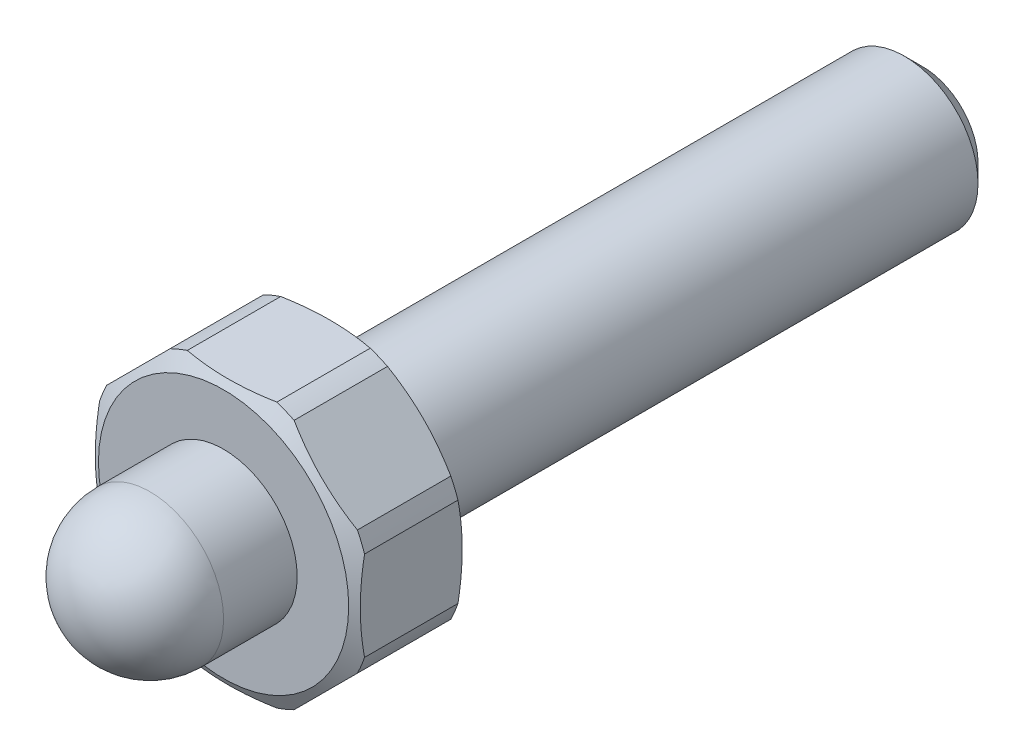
ISO-10303-21;
HEADER;
FILE_DESCRIPTION(('STEP AP214'),'2;1');
FILE_NAME('part.step','',(''),(''),'','','');
FILE_SCHEMA(('AUTOMOTIVE_DESIGN { 1 0 10303 214 1 1 1 1 }'));
ENDSEC;
DATA;
#1=APPLICATION_CONTEXT('core data for automotive mechanical design processes');
#2=APPLICATION_PROTOCOL_DEFINITION('international standard','automotive_design',2000,#1);
#3=PRODUCT_CONTEXT('',#1,'mechanical');
#4=PRODUCT('Part','Part','',(#3));
#5=PRODUCT_RELATED_PRODUCT_CATEGORY('part','',(#4));
#6=PRODUCT_DEFINITION_FORMATION('','',#4);
#7=PRODUCT_DEFINITION_CONTEXT('part definition',#1,'design');
#8=PRODUCT_DEFINITION('design','',#6,#7);
#9=PRODUCT_DEFINITION_SHAPE('','',#8);
#10=(LENGTH_UNIT() NAMED_UNIT(*) SI_UNIT(.MILLI.,.METRE.));
#11=(NAMED_UNIT(*) PLANE_ANGLE_UNIT() SI_UNIT($,.RADIAN.));
#12=(NAMED_UNIT(*) SI_UNIT($,.STERADIAN.) SOLID_ANGLE_UNIT());
#13=UNCERTAINTY_MEASURE_WITH_UNIT(LENGTH_MEASURE(1.E-05),#10,'distance_accuracy_value','');
#14=(GEOMETRIC_REPRESENTATION_CONTEXT(3) GLOBAL_UNCERTAINTY_ASSIGNED_CONTEXT((#13)) GLOBAL_UNIT_ASSIGNED_CONTEXT((#10,
#11,#12)) REPRESENTATION_CONTEXT('',''));
#15=CARTESIAN_POINT('',(0.,0.,0.));
#16=DIRECTION('',(0.,0.,1.));
#17=DIRECTION('',(1.,0.,0.));
#18=AXIS2_PLACEMENT_3D('',#15,#16,#17);
#19=CARTESIAN_POINT('',(-18.,7.45584412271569,95.));
#20=DIRECTION('',(-0.707106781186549,0.707106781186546,0.));
#21=DIRECTION('',(-0.707106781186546,-0.707106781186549,0.));
#22=AXIS2_PLACEMENT_3D('',#19,#20,#21);
#23=PLANE('',#22);
#24=CARTESIAN_POINT('',(-17.0292846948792,8.42655942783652,81.1547528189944));
#25=CARTESIAN_POINT('',(-16.7274170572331,8.72842706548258,81.0758082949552));
#26=CARTESIAN_POINT('',(-16.4245693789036,9.03127474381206,81.0041272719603));
#27=CARTESIAN_POINT('',(-15.8171697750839,9.63867434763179,80.8764009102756));
#28=CARTESIAN_POINT('',(-15.5126175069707,9.943226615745,80.8203588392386));
#29=CARTESIAN_POINT('',(-14.9021152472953,10.5537288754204,80.7250411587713));
#30=CARTESIAN_POINT('',(-14.5961649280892,10.8596791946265,80.6857697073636));
#31=CARTESIAN_POINT('',(-13.9834090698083,11.4724350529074,80.6248351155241));
#32=CARTESIAN_POINT('',(-13.676603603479,11.7792405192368,80.6031705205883));
#33=CARTESIAN_POINT('',(-13.0669643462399,12.3888797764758,80.5781066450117));
#34=CARTESIAN_POINT('',(-12.7641358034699,12.6917083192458,80.574453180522));
#35=CARTESIAN_POINT('',(-12.1586149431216,13.2972291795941,80.584804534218));
#36=CARTESIAN_POINT('',(-11.8559226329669,13.5999214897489,80.5988102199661));
#37=CARTESIAN_POINT('',(-11.2513634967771,14.2044806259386,80.6441613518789));
#38=CARTESIAN_POINT('',(-10.9494963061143,14.5063478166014,80.6754971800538));
#39=CARTESIAN_POINT('',(-10.3468904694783,15.1089536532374,80.7548419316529));
#40=CARTESIAN_POINT('',(-10.0461517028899,15.4096924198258,80.8028490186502));
#41=CARTESIAN_POINT('',(-9.63590506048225,15.8199390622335,80.879250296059));
#42=CARTESIAN_POINT('',(-9.52574484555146,15.9300992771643,80.9008465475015));
#43=CARTESIAN_POINT('',(-9.30564817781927,16.1501959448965,80.9461055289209));
#44=CARTESIAN_POINT('',(-9.19571170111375,16.260132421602,80.9697680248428));
#45=CARTESIAN_POINT('',(-8.97577054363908,16.4800735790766,81.0191715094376));
#46=CARTESIAN_POINT('',(-8.86576647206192,16.5900776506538,81.0449179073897));
#47=CARTESIAN_POINT('',(-8.64598646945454,16.8098576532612,81.0983764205));
#48=CARTESIAN_POINT('',(-8.5362105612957,16.91963356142,81.1260887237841));
#49=CARTESIAN_POINT('',(-8.42655942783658,17.0292846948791,81.1547528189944));
#50=B_SPLINE_CURVE_WITH_KNOTS('',3,(#24,#25,#26,#27,#28,#29,#30,#31,#32,#33,#34,#35,#36,#37,#38,
#39,#40,#41,#42,#43,#44,#45,#46,#47,#48,#49),.UNSPECIFIED.,.F.,.F.,(4,2,2,2,2,2,2,2,2,2,2,2,4),
(0.,1.30242981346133,2.60513155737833,3.90815609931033,5.21107298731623,6.4955486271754,
7.7800873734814,9.06391393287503,10.3475991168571,10.8194295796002,11.2912066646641,
11.7642502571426,12.2373391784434),.UNSPECIFIED.);
#51=CARTESIAN_POINT('',(-17.0290846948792,8.42675942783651,81.1547005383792));
#52=VERTEX_POINT('',#51);
#53=CARTESIAN_POINT('',(-8.42675942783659,17.0290846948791,81.1547005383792));
#54=VERTEX_POINT('',#53);
#55=EDGE_CURVE('E210',#52,#54,#50,.T.);
#56=ORIENTED_EDGE('',*,*,#55,.F.);
#57=DIRECTION('',(0.,0.,-1.));
#58=VECTOR('',#57,1.);
#59=CARTESIAN_POINT('',(-17.0290846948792,8.42675942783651,63.2590267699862));
#60=LINE('',#59,#58);
#61=CARTESIAN_POINT('',(-17.0290846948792,8.42675942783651,93.8452994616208));
#62=VERTEX_POINT('',#61);
#63=EDGE_CURVE('E311',#62,#52,#60,.T.);
#64=ORIENTED_EDGE('',*,*,#63,.F.);
#65=CARTESIAN_POINT('',(-8.42655942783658,17.0292846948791,93.8452471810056));
#66=CARTESIAN_POINT('',(-8.72842706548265,16.7274170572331,93.9241917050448));
#67=CARTESIAN_POINT('',(-9.03127474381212,16.4245693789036,93.9958727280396));
#68=CARTESIAN_POINT('',(-9.63867434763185,15.8171697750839,94.1235990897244));
#69=CARTESIAN_POINT('',(-9.94322661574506,15.5126175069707,94.1796411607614));
#70=CARTESIAN_POINT('',(-10.5537288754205,14.9021152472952,94.2749588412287));
#71=CARTESIAN_POINT('',(-10.8596791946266,14.5961649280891,94.3142302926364));
#72=CARTESIAN_POINT('',(-11.4724350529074,13.9834090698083,94.3751648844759));
#73=CARTESIAN_POINT('',(-11.7792405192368,13.6766036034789,94.3968294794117));
#74=CARTESIAN_POINT('',(-12.3888797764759,13.0669643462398,94.4218933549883));
#75=CARTESIAN_POINT('',(-12.6917083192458,12.7641358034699,94.425546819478));
#76=CARTESIAN_POINT('',(-13.2972291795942,12.1586149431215,94.415195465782));
#77=CARTESIAN_POINT('',(-13.5999214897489,11.8559226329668,94.4011897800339));
#78=CARTESIAN_POINT('',(-14.2044806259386,11.2513634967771,94.355838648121));
#79=CARTESIAN_POINT('',(-14.5063478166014,10.9494963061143,94.3245028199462));
#80=CARTESIAN_POINT('',(-15.1089536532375,10.3468904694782,94.2451580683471));
#81=CARTESIAN_POINT('',(-15.4096924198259,10.0461517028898,94.1971509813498));
#82=CARTESIAN_POINT('',(-15.8199390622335,9.63590506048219,94.120749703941));
#83=CARTESIAN_POINT('',(-15.9300992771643,9.52574484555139,94.0991534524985));
#84=CARTESIAN_POINT('',(-16.1501959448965,9.3056481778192,94.0538944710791));
#85=CARTESIAN_POINT('',(-16.260132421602,9.19571170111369,94.0302319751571));
#86=CARTESIAN_POINT('',(-16.4800735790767,8.97577054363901,93.9808284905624));
#87=CARTESIAN_POINT('',(-16.5900776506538,8.86576647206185,93.9550820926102));
#88=CARTESIAN_POINT('',(-16.8098576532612,8.64598646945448,93.9016235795));
#89=CARTESIAN_POINT('',(-16.9196335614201,8.53621056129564,93.8739112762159));
#90=CARTESIAN_POINT('',(-17.0292846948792,8.42655942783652,93.8452471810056));
#91=B_SPLINE_CURVE_WITH_KNOTS('',3,(#65,#66,#67,#68,#69,#70,#71,#72,#73,#74,#75,#76,#77,#78,#79,
#80,#81,#82,#83,#84,#85,#86,#87,#88,#89,#90),.UNSPECIFIED.,.F.,.F.,(4,2,2,2,2,2,2,2,2,2,2,2,4),
(0.,1.30242981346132,2.60513155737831,3.90815609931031,5.21107298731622,6.49554862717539,
7.7800873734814,9.06391393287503,10.3475991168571,10.8194295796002,11.2912066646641,
11.7642502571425,12.2373391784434),.UNSPECIFIED.);
#92=CARTESIAN_POINT('',(-8.42675942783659,17.0290846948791,93.8452994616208));
#93=VERTEX_POINT('',#92);
#94=EDGE_CURVE('E202',#93,#62,#91,.T.);
#95=ORIENTED_EDGE('',*,*,#94,.F.);
#96=DIRECTION('',(0.,0.,-1.));
#97=VECTOR('',#96,1.);
#98=CARTESIAN_POINT('',(-8.42675942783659,17.0290846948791,63.2590267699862));
#99=LINE('',#98,#97);
#100=EDGE_CURVE('E317',#54,#93,#99,.F.);
#101=ORIENTED_EDGE('',*,*,#100,.F.);
#102=EDGE_LOOP('',(#56,#64,#95,#101));
#103=FACE_BOUND('',#102,.T.);
#104=ADVANCED_FACE('F14',(#103),#23,.T.);
#105=CARTESIAN_POINT('',(-18.,7.45584412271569,95.));
#106=DIRECTION('',(1.,0.,0.));
#107=DIRECTION('',(0.,0.,-1.));
#108=AXIS2_PLACEMENT_3D('',#105,#106,#107);
#109=PLANE('',#108);
#110=DIRECTION('',(0.,0.,-1.));
#111=VECTOR('',#110,1.);
#112=CARTESIAN_POINT('',(-18.,6.08276253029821,63.2590267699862));
#113=LINE('',#112,#111);
#114=CARTESIAN_POINT('',(-18.,6.08276253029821,93.8452994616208));
#115=VERTEX_POINT('',#114);
#116=CARTESIAN_POINT('',(-18.,6.08276253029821,81.1547005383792));
#117=VERTEX_POINT('',#116);
#118=EDGE_CURVE('E134',#115,#117,#113,.T.);
#119=ORIENTED_EDGE('',*,*,#118,.T.);
#120=CARTESIAN_POINT('',(-18.,-20.4360834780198,85.9079958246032));
#121=CARTESIAN_POINT('',(-18.,-20.1164860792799,85.7695326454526));
#122=CARTESIAN_POINT('',(-18.,-19.796374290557,85.6322579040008));
#123=CARTESIAN_POINT('',(-18.,-19.1550316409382,85.3603302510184));
#124=CARTESIAN_POINT('',(-18.,-18.8338007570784,85.2256773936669));
#125=CARTESIAN_POINT('',(-18.,-17.868151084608,84.8259602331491));
#126=CARTESIAN_POINT('',(-18.,-17.2219368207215,84.5652076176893));
#127=CARTESIAN_POINT('',(-18.,-15.9203360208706,84.0561973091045));
#128=CARTESIAN_POINT('',(-18.,-15.2649181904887,83.8080193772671));
#129=CARTESIAN_POINT('',(-18.,-13.9478402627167,83.3288746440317));
#130=CARTESIAN_POINT('',(-18.,-13.2861806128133,83.0979066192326));
#131=CARTESIAN_POINT('',(-18.,-11.9667477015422,82.660569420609));
#132=CARTESIAN_POINT('',(-18.,-11.309088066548,82.45385951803));
#133=CARTESIAN_POINT('',(-18.,-9.98642425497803,82.0650673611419));
#134=CARTESIAN_POINT('',(-18.,-9.32141964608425,81.8829865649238));
#135=CARTESIAN_POINT('',(-18.,-7.98536030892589,81.5487942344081));
#136=CARTESIAN_POINT('',(-18.,-7.31432145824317,81.3966197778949));
#137=CARTESIAN_POINT('',(-18.,-5.96530155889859,81.1270891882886));
#138=CARTESIAN_POINT('',(-18.,-5.28732195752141,81.0097259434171));
#139=CARTESIAN_POINT('',(-18.,-4.18983470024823,80.8526216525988));
#140=CARTESIAN_POINT('',(-18.,-3.77208866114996,80.8004306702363));
#141=CARTESIAN_POINT('',(-18.,-2.93492906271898,80.7119092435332));
#142=CARTESIAN_POINT('',(-18.,-2.51551562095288,80.6755777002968));
#143=CARTESIAN_POINT('',(-18.,-1.67549905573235,80.6194950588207));
#144=CARTESIAN_POINT('',(-18.,-1.25489572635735,80.5997470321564));
#145=CARTESIAN_POINT('',(-18.,-0.413227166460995,80.5772547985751));
#146=CARTESIAN_POINT('',(-18.,0.00783806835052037,80.5745107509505));
#147=CARTESIAN_POINT('',(-18.,0.851219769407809,80.586106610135));
#148=CARTESIAN_POINT('',(-18.,1.27353540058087,80.6005069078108));
#149=CARTESIAN_POINT('',(-18.,2.11724480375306,80.6461847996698));
#150=CARTESIAN_POINT('',(-18.,2.53863857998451,80.6774623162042));
#151=CARTESIAN_POINT('',(-18.,3.37976632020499,80.7562426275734));
#152=CARTESIAN_POINT('',(-18.,3.79950075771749,80.8037403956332));
#153=CARTESIAN_POINT('',(-18.,4.63697891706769,80.914060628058));
#154=CARTESIAN_POINT('',(-18.,5.05472243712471,80.9768846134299));
#155=CARTESIAN_POINT('',(-18.,5.96079175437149,81.1290190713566));
#156=CARTESIAN_POINT('',(-18.,6.4486616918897,81.2210415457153));
#157=CARTESIAN_POINT('',(-18.,7.42075747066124,81.4228065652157));
#158=CARTESIAN_POINT('',(-18.,7.90498285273,81.5325513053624));
#159=CARTESIAN_POINT('',(-18.,8.86982136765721,81.7678256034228));
#160=CARTESIAN_POINT('',(-18.,9.35043256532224,81.8933630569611));
#161=CARTESIAN_POINT('',(-18.,10.3077838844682,82.1582640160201));
#162=CARTESIAN_POINT('',(-18.,10.7845242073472,82.29762679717));
#163=CARTESIAN_POINT('',(-18.,11.7362771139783,82.589033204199));
#164=CARTESIAN_POINT('',(-18.,12.2112741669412,82.741127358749));
#165=CARTESIAN_POINT('',(-18.,13.1577376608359,83.0558964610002));
#166=CARTESIAN_POINT('',(-18.,13.6292041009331,83.2185714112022));
#167=CARTESIAN_POINT('',(-18.,14.5687514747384,83.5530642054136));
#168=CARTESIAN_POINT('',(-18.,15.0368331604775,83.7248799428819));
#169=CARTESIAN_POINT('',(-18.,15.9699998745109,84.0764807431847));
#170=CARTESIAN_POINT('',(-18.,16.4350848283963,84.256266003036));
#171=CARTESIAN_POINT('',(-18.,17.3637893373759,84.6232612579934));
#172=CARTESIAN_POINT('',(-18.,17.8274013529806,84.8104902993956));
#173=CARTESIAN_POINT('',(-18.,18.7521317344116,85.1910154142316));
#174=CARTESIAN_POINT('',(-18.,19.2132500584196,85.3843115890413));
#175=CARTESIAN_POINT('',(-18.,20.5932877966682,85.9721362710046));
#176=CARTESIAN_POINT('',(-18.,21.5088414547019,86.3745815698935));
#177=CARTESIAN_POINT('',(-18.,22.8719396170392,86.9882832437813));
#178=CARTESIAN_POINT('',(-18.,23.3222652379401,87.1934213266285));
#179=CARTESIAN_POINT('',(-18.,24.2212959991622,87.6072286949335));
#180=CARTESIAN_POINT('',(-18.,24.6700011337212,87.815897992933));
#181=CARTESIAN_POINT('',(-18.,25.5658243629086,88.2362993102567));
#182=CARTESIAN_POINT('',(-18.,26.0129428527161,88.4480304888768));
#183=CARTESIAN_POINT('',(-18.,26.9058443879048,88.8742729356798));
#184=CARTESIAN_POINT('',(-18.,27.3516274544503,89.0887841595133));
#185=CARTESIAN_POINT('',(-18.,27.7968149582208,89.3045199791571));
#186=B_SPLINE_CURVE_WITH_KNOTS('',3,(#120,#121,#122,#123,#124,#125,#126,#127,#128,#129,#130,
#131,#132,#133,#134,#135,#136,#137,#138,#139,#140,#141,#142,#143,#144,#145,#146,#147,#148,#149,
#150,#151,#152,#153,#154,#155,#156,#157,#158,#159,#160,#161,#162,#163,#164,#165,#166,#167,#168,
#169,#170,#171,#172,#173,#174,#175,#176,#177,#178,#179,#180,#181,#182,#183,#184,#185),
.UNSPECIFIED.,.F.,.F.,(4,2,2,2,2,2,2,2,2,2,2,2,2,2,2,2,2,2,2,2,2,2,2,2,2,2,2,2,2,2,2,2,4),(0.,
1.04490264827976,2.08982686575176,4.18020374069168,6.28250500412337,8.38465667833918,
10.452403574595,12.5202728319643,14.583743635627,16.6467925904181,17.9095098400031,
19.1721395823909,20.4350031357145,21.6978785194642,22.9652155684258,24.2325467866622,
25.4994856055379,26.7665502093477,28.2555915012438,29.7448173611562,31.2347907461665,
32.724686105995,34.2208037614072,35.7169217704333,37.2126964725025,38.7085081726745,
40.2084305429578,41.7083779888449,44.7084295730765,46.1929663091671,47.6775083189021,
49.1616501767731,50.6457683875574),.UNSPECIFIED.);
#187=CARTESIAN_POINT('',(-18.,-6.08276253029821,81.1547005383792));
#188=VERTEX_POINT('',#187);
#189=EDGE_CURVE('E126',#117,#188,#186,.F.);
#190=ORIENTED_EDGE('',*,*,#189,.T.);
#191=DIRECTION('',(0.,0.,-1.));
#192=VECTOR('',#191,1.);
#193=CARTESIAN_POINT('',(-18.,-6.08276253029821,63.2590267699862));
#194=LINE('',#193,#192);
#195=CARTESIAN_POINT('',(-18.,-6.08276253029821,93.8452994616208));
#196=VERTEX_POINT('',#195);
#197=EDGE_CURVE('E36',#188,#196,#194,.F.);
#198=ORIENTED_EDGE('',*,*,#197,.T.);
#199=CARTESIAN_POINT('',(-18.,-20.4360834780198,89.0920041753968));
#200=CARTESIAN_POINT('',(-18.,-20.1164860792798,89.2304673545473));
#201=CARTESIAN_POINT('',(-18.,-19.7963742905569,89.3677420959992));
#202=CARTESIAN_POINT('',(-18.,-19.1550316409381,89.6396697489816));
#203=CARTESIAN_POINT('',(-18.,-18.8338007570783,89.774322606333));
#204=CARTESIAN_POINT('',(-18.,-17.868151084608,90.1740397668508));
#205=CARTESIAN_POINT('',(-18.,-17.2219368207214,90.4347923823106));
#206=CARTESIAN_POINT('',(-18.,-15.9203360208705,90.9438026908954));
#207=CARTESIAN_POINT('',(-18.,-15.2649181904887,91.1919806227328));
#208=CARTESIAN_POINT('',(-18.,-13.9478402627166,91.6711253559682));
#209=CARTESIAN_POINT('',(-18.,-13.2861806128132,91.9020933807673));
#210=CARTESIAN_POINT('',(-18.,-11.9667477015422,92.3394305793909));
#211=CARTESIAN_POINT('',(-18.,-11.309088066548,92.5461404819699));
#212=CARTESIAN_POINT('',(-18.,-9.986424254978,92.9349326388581));
#213=CARTESIAN_POINT('',(-18.,-9.32141964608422,93.1170134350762));
#214=CARTESIAN_POINT('',(-18.,-7.98536030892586,93.4512057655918));
#215=CARTESIAN_POINT('',(-18.,-7.31432145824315,93.603380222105));
#216=CARTESIAN_POINT('',(-18.,-5.96530155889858,93.8729108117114));
#217=CARTESIAN_POINT('',(-18.,-5.2873219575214,93.9902740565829));
#218=CARTESIAN_POINT('',(-18.,-4.18983470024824,94.1473783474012));
#219=CARTESIAN_POINT('',(-18.,-3.77208866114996,94.1995693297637));
#220=CARTESIAN_POINT('',(-18.,-2.93492906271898,94.2880907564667));
#221=CARTESIAN_POINT('',(-18.,-2.51551562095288,94.3244222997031));
#222=CARTESIAN_POINT('',(-18.,-1.67549905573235,94.3805049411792));
#223=CARTESIAN_POINT('',(-18.,-1.25489572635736,94.4002529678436));
#224=CARTESIAN_POINT('',(-18.,-0.413227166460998,94.4227452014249));
#225=CARTESIAN_POINT('',(-18.,0.0078380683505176,94.4254892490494));
#226=CARTESIAN_POINT('',(-18.,0.851219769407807,94.4138933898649));
#227=CARTESIAN_POINT('',(-18.,1.27353540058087,94.3994930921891));
#228=CARTESIAN_POINT('',(-18.,2.11724480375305,94.3538152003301));
#229=CARTESIAN_POINT('',(-18.,2.53863857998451,94.3225376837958));
#230=CARTESIAN_POINT('',(-18.,3.37976632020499,94.2437573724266));
#231=CARTESIAN_POINT('',(-18.,3.79950075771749,94.1962596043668));
#232=CARTESIAN_POINT('',(-18.,4.63697891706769,94.085939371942));
#233=CARTESIAN_POINT('',(-18.,5.05472243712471,94.0231153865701));
#234=CARTESIAN_POINT('',(-18.,5.96079175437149,93.8709809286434));
#235=CARTESIAN_POINT('',(-18.,6.44866169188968,93.7789584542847));
#236=CARTESIAN_POINT('',(-18.,7.42075747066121,93.5771934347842));
#237=CARTESIAN_POINT('',(-18.,7.90498285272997,93.4674486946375));
#238=CARTESIAN_POINT('',(-18.,8.86982136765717,93.2321743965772));
#239=CARTESIAN_POINT('',(-18.,9.35043256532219,93.1066369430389));
#240=CARTESIAN_POINT('',(-18.,10.3077838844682,92.8417359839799));
#241=CARTESIAN_POINT('',(-18.,10.7845242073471,92.70237320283));
#242=CARTESIAN_POINT('',(-18.,11.7362771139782,92.4109667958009));
#243=CARTESIAN_POINT('',(-18.,12.2112741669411,92.2588726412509));
#244=CARTESIAN_POINT('',(-18.,13.1577376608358,91.9441035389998));
#245=CARTESIAN_POINT('',(-18.,13.6292041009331,91.7814285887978));
#246=CARTESIAN_POINT('',(-18.,14.5687514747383,91.4469357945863));
#247=CARTESIAN_POINT('',(-18.,15.0368331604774,91.2751200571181));
#248=CARTESIAN_POINT('',(-18.,15.9699998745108,90.9235192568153));
#249=CARTESIAN_POINT('',(-18.,16.4350848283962,90.743733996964));
#250=CARTESIAN_POINT('',(-18.,17.3637893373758,90.3767387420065));
#251=CARTESIAN_POINT('',(-18.,17.8274013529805,90.1895097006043));
#252=CARTESIAN_POINT('',(-18.,18.7521317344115,89.8089845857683));
#253=CARTESIAN_POINT('',(-18.,19.2132500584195,89.6156884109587));
#254=CARTESIAN_POINT('',(-18.,20.5932877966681,89.0278637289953));
#255=CARTESIAN_POINT('',(-18.,21.5088414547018,88.6254184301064));
#256=CARTESIAN_POINT('',(-18.,22.871939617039,88.0117167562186));
#257=CARTESIAN_POINT('',(-18.,23.3222652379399,87.8065786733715));
#258=CARTESIAN_POINT('',(-18.,24.221295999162,87.3927713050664));
#259=CARTESIAN_POINT('',(-18.,24.670001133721,87.1841020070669));
#260=CARTESIAN_POINT('',(-18.,25.5658243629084,86.7637006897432));
#261=CARTESIAN_POINT('',(-18.,26.0129428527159,86.5519695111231));
#262=CARTESIAN_POINT('',(-18.,26.9058443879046,86.1257270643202));
#263=CARTESIAN_POINT('',(-18.,27.3516274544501,85.9112158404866));
#264=CARTESIAN_POINT('',(-18.,27.7968149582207,85.695480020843));
#265=B_SPLINE_CURVE_WITH_KNOTS('',3,(#199,#200,#201,#202,#203,#204,#205,#206,#207,#208,#209,
#210,#211,#212,#213,#214,#215,#216,#217,#218,#219,#220,#221,#222,#223,#224,#225,#226,#227,#228,
#229,#230,#231,#232,#233,#234,#235,#236,#237,#238,#239,#240,#241,#242,#243,#244,#245,#246,#247,
#248,#249,#250,#251,#252,#253,#254,#255,#256,#257,#258,#259,#260,#261,#262,#263,#264),
.UNSPECIFIED.,.F.,.F.,(4,2,2,2,2,2,2,2,2,2,2,2,2,2,2,2,2,2,2,2,2,2,2,2,2,2,2,2,2,2,2,2,4),(0.,
1.04490264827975,2.08982686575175,4.18020374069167,6.28250500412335,8.38465667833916,
10.452403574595,12.5202728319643,14.583743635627,16.6467925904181,17.909509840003,
19.1721395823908,20.4350031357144,21.6978785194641,22.9652155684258,24.2325467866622,
25.4994856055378,26.7665502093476,28.2555915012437,29.7448173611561,31.2347907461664,
32.7246861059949,34.2208037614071,35.7169217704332,37.2126964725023,38.7085081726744,
40.2084305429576,41.7083779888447,44.7084295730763,46.1929663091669,47.6775083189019,
49.1616501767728,50.6457683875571),.UNSPECIFIED.);
#266=EDGE_CURVE('E353',#196,#115,#265,.T.);
#267=ORIENTED_EDGE('',*,*,#266,.T.);
#268=EDGE_LOOP('',(#119,#190,#198,#267));
#269=FACE_BOUND('',#268,.T.);
#270=ADVANCED_FACE('F132',(#269),#109,.F.);
#271=CARTESIAN_POINT('',(-18.,-7.45584412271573,95.));
#272=DIRECTION('',(0.707106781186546,0.707106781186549,0.));
#273=DIRECTION('',(-0.707106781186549,0.707106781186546,0.));
#274=AXIS2_PLACEMENT_3D('',#271,#272,#273);
#275=PLANE('',#274);
#276=DIRECTION('',(0.,0.,-1.));
#277=VECTOR('',#276,1.);
#278=CARTESIAN_POINT('',(-17.0290846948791,-8.42675942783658,63.2590267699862));
#279=LINE('',#278,#277);
#280=CARTESIAN_POINT('',(-17.0290846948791,-8.42675942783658,93.8452994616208));
#281=VERTEX_POINT('',#280);
#282=CARTESIAN_POINT('',(-17.0290846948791,-8.42675942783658,81.1547005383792));
#283=VERTEX_POINT('',#282);
#284=EDGE_CURVE('E140',#281,#283,#279,.T.);
#285=ORIENTED_EDGE('',*,*,#284,.T.);
#286=CARTESIAN_POINT('',(-17.0292846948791,-8.42655942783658,81.1547528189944));
#287=CARTESIAN_POINT('',(-16.7274170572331,-8.72842706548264,81.0758082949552));
#288=CARTESIAN_POINT('',(-16.4245693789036,-9.03127474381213,81.0041272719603));
#289=CARTESIAN_POINT('',(-15.8171697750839,-9.63867434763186,80.8764009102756));
#290=CARTESIAN_POINT('',(-15.5126175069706,-9.94322661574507,80.8203588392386));
#291=CARTESIAN_POINT('',(-14.9021152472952,-10.5537288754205,80.7250411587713));
#292=CARTESIAN_POINT('',(-14.5961649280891,-10.8596791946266,80.6857697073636));
#293=CARTESIAN_POINT('',(-13.9834090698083,-11.4724350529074,80.6248351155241));
#294=CARTESIAN_POINT('',(-13.6766036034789,-11.7792405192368,80.6031705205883));
#295=CARTESIAN_POINT('',(-13.0669643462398,-12.3888797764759,80.5781066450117));
#296=CARTESIAN_POINT('',(-12.7641358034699,-12.6917083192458,80.574453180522));
#297=CARTESIAN_POINT('',(-12.1586149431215,-13.2972291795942,80.584804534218));
#298=CARTESIAN_POINT('',(-11.8559226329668,-13.5999214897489,80.5988102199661));
#299=CARTESIAN_POINT('',(-11.2513634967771,-14.2044806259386,80.6441613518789));
#300=CARTESIAN_POINT('',(-10.9494963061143,-14.5063478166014,80.6754971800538));
#301=CARTESIAN_POINT('',(-10.3468904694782,-15.1089536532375,80.7548419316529));
#302=CARTESIAN_POINT('',(-10.0461517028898,-15.4096924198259,80.8028490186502));
#303=CARTESIAN_POINT('',(-9.63590506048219,-15.8199390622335,80.879250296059));
#304=CARTESIAN_POINT('',(-9.52574484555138,-15.9300992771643,80.9008465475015));
#305=CARTESIAN_POINT('',(-9.30564817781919,-16.1501959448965,80.9461055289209));
#306=CARTESIAN_POINT('',(-9.19571170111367,-16.260132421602,80.9697680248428));
#307=CARTESIAN_POINT('',(-8.975770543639,-16.4800735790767,81.0191715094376));
#308=CARTESIAN_POINT('',(-8.86576647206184,-16.5900776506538,81.0449179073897));
#309=CARTESIAN_POINT('',(-8.64598646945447,-16.8098576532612,81.0983764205));
#310=CARTESIAN_POINT('',(-8.53621056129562,-16.9196335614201,81.1260887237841));
#311=CARTESIAN_POINT('',(-8.4265594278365,-17.0292846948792,81.1547528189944));
#312=B_SPLINE_CURVE_WITH_KNOTS('',3,(#286,#287,#288,#289,#290,#291,#292,#293,#294,#295,#296,
#297,#298,#299,#300,#301,#302,#303,#304,#305,#306,#307,#308,#309,#310,#311),.UNSPECIFIED.,.F.,
.F.,(4,2,2,2,2,2,2,2,2,2,2,2,4),(0.,1.30242981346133,2.60513155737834,3.90815609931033,
5.21107298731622,6.4955486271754,7.7800873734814,9.06391393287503,10.3475991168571,
10.8194295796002,11.2912066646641,11.7642502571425,12.2373391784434),.UNSPECIFIED.);
#313=CARTESIAN_POINT('',(-8.42675942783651,-17.0290846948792,81.1547005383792));
#314=VERTEX_POINT('',#313);
#315=EDGE_CURVE('E29',#283,#314,#312,.T.);
#316=ORIENTED_EDGE('',*,*,#315,.T.);
#317=DIRECTION('',(0.,0.,-1.));
#318=VECTOR('',#317,1.);
#319=CARTESIAN_POINT('',(-8.4267594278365,-17.0290846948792,63.2590267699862));
#320=LINE('',#319,#318);
#321=CARTESIAN_POINT('',(-8.42675942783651,-17.0290846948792,93.8452994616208));
#322=VERTEX_POINT('',#321);
#323=EDGE_CURVE('E145',#314,#322,#320,.F.);
#324=ORIENTED_EDGE('',*,*,#323,.T.);
#325=CARTESIAN_POINT('',(-8.4265594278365,-17.0292846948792,93.8452471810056));
#326=CARTESIAN_POINT('',(-8.72842706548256,-16.7274170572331,93.9241917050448));
#327=CARTESIAN_POINT('',(-9.03127474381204,-16.4245693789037,93.9958727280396));
#328=CARTESIAN_POINT('',(-9.63867434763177,-15.8171697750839,94.1235990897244));
#329=CARTESIAN_POINT('',(-9.94322661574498,-15.5126175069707,94.1796411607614));
#330=CARTESIAN_POINT('',(-10.5537288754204,-14.9021152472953,94.2749588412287));
#331=CARTESIAN_POINT('',(-10.8596791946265,-14.5961649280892,94.3142302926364));
#332=CARTESIAN_POINT('',(-11.4724350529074,-13.9834090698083,94.3751648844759));
#333=CARTESIAN_POINT('',(-11.7792405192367,-13.676603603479,94.3968294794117));
#334=CARTESIAN_POINT('',(-12.3888797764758,-13.0669643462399,94.4218933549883));
#335=CARTESIAN_POINT('',(-12.6917083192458,-12.76413580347,94.425546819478));
#336=CARTESIAN_POINT('',(-13.2972291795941,-12.1586149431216,94.415195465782));
#337=CARTESIAN_POINT('',(-13.5999214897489,-11.8559226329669,94.4011897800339));
#338=CARTESIAN_POINT('',(-14.2044806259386,-11.2513634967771,94.355838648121));
#339=CARTESIAN_POINT('',(-14.5063478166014,-10.9494963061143,94.3245028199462));
#340=CARTESIAN_POINT('',(-15.1089536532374,-10.3468904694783,94.2451580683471));
#341=CARTESIAN_POINT('',(-15.4096924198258,-10.0461517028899,94.1971509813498));
#342=CARTESIAN_POINT('',(-15.8199390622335,-9.63590506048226,94.120749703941));
#343=CARTESIAN_POINT('',(-15.9300992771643,-9.52574484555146,94.0991534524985));
#344=CARTESIAN_POINT('',(-16.1501959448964,-9.30564817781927,94.0538944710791));
#345=CARTESIAN_POINT('',(-16.260132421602,-9.19571170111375,94.0302319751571));
#346=CARTESIAN_POINT('',(-16.4800735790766,-8.97577054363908,93.9808284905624));
#347=CARTESIAN_POINT('',(-16.5900776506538,-8.86576647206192,93.9550820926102));
#348=CARTESIAN_POINT('',(-16.8098576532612,-8.64598646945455,93.9016235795));
#349=CARTESIAN_POINT('',(-16.91963356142,-8.53621056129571,93.8739112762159));
#350=CARTESIAN_POINT('',(-17.0292846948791,-8.42655942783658,93.8452471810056));
#351=B_SPLINE_CURVE_WITH_KNOTS('',3,(#325,#326,#327,#328,#329,#330,#331,#332,#333,#334,#335,
#336,#337,#338,#339,#340,#341,#342,#343,#344,#345,#346,#347,#348,#349,#350),.UNSPECIFIED.,.F.,
.F.,(4,2,2,2,2,2,2,2,2,2,2,2,4),(0.,1.30242981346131,2.60513155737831,3.90815609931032,
5.21107298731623,6.4955486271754,7.78008737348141,9.06391393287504,10.3475991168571,
10.8194295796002,11.2912066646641,11.7642502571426,12.2373391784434),.UNSPECIFIED.);
#352=EDGE_CURVE('E344',#322,#281,#351,.T.);
#353=ORIENTED_EDGE('',*,*,#352,.T.);
#354=EDGE_LOOP('',(#285,#316,#324,#353));
#355=FACE_BOUND('',#354,.T.);
#356=ADVANCED_FACE('F190',(#355),#275,.F.);
#357=CARTESIAN_POINT('',(7.45584412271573,-18.,95.));
#358=DIRECTION('',(0.,-1.,0.));
#359=DIRECTION('',(1.,0.,0.));
#360=AXIS2_PLACEMENT_3D('',#357,#358,#359);
#361=PLANE('',#360);
#362=CARTESIAN_POINT('',(-20.4360834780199,-18.,85.9079958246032));
#363=CARTESIAN_POINT('',(-20.1164860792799,-18.,85.7695326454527));
#364=CARTESIAN_POINT('',(-19.796374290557,-18.,85.6322579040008));
#365=CARTESIAN_POINT('',(-19.1550316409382,-18.,85.3603302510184));
#366=CARTESIAN_POINT('',(-18.8338007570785,-18.,85.2256773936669));
#367=CARTESIAN_POINT('',(-17.8681510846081,-18.,84.8259602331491));
#368=CARTESIAN_POINT('',(-17.2219368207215,-18.,84.5652076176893));
#369=CARTESIAN_POINT('',(-15.9203360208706,-18.,84.0561973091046));
#370=CARTESIAN_POINT('',(-15.2649181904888,-18.,83.8080193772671));
#371=CARTESIAN_POINT('',(-13.9478402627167,-18.,83.3288746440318));
#372=CARTESIAN_POINT('',(-13.2861806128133,-18.,83.0979066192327));
#373=CARTESIAN_POINT('',(-11.9667477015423,-18.,82.660569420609));
#374=CARTESIAN_POINT('',(-11.309088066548,-18.,82.45385951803));
#375=CARTESIAN_POINT('',(-9.98642425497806,-18.,82.0650673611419));
#376=CARTESIAN_POINT('',(-9.32141964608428,-18.,81.8829865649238));
#377=CARTESIAN_POINT('',(-7.98536030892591,-18.,81.5487942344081));
#378=CARTESIAN_POINT('',(-7.31432145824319,-18.,81.3966197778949));
#379=CARTESIAN_POINT('',(-5.96530155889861,-18.,81.1270891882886));
#380=CARTESIAN_POINT('',(-5.28732195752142,-18.,81.0097259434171));
#381=CARTESIAN_POINT('',(-4.18983470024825,-18.,80.8526216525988));
#382=CARTESIAN_POINT('',(-3.77208866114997,-18.,80.8004306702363));
#383=CARTESIAN_POINT('',(-2.934929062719,-18.,80.7119092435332));
#384=CARTESIAN_POINT('',(-2.5155156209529,-18.,80.6755777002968));
#385=CARTESIAN_POINT('',(-1.67549905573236,-18.,80.6194950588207));
#386=CARTESIAN_POINT('',(-1.25489572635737,-18.,80.5997470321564));
#387=CARTESIAN_POINT('',(-0.41322716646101,-18.,80.5772547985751));
#388=CARTESIAN_POINT('',(0.00783806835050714,-18.,80.5745107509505));
#389=CARTESIAN_POINT('',(0.851219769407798,-18.,80.586106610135));
#390=CARTESIAN_POINT('',(1.27353540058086,-18.,80.6005069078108));
#391=CARTESIAN_POINT('',(2.11724480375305,-18.,80.6461847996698));
#392=CARTESIAN_POINT('',(2.5386385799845,-18.,80.6774623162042));
#393=CARTESIAN_POINT('',(3.37976632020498,-18.,80.7562426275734));
#394=CARTESIAN_POINT('',(3.79950075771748,-18.,80.8037403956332));
#395=CARTESIAN_POINT('',(4.63697891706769,-18.,80.914060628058));
#396=CARTESIAN_POINT('',(5.0547224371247,-18.,80.9768846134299));
#397=CARTESIAN_POINT('',(5.96079175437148,-18.,81.1290190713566));
#398=CARTESIAN_POINT('',(6.44866169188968,-18.,81.2210415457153));
#399=CARTESIAN_POINT('',(7.42075747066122,-18.,81.4228065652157));
#400=CARTESIAN_POINT('',(7.90498285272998,-18.,81.5325513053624));
#401=CARTESIAN_POINT('',(8.86982136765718,-18.,81.7678256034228));
#402=CARTESIAN_POINT('',(9.35043256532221,-18.,81.8933630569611));
#403=CARTESIAN_POINT('',(10.3077838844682,-18.,82.1582640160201));
#404=CARTESIAN_POINT('',(10.7845242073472,-18.,82.29762679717));
#405=CARTESIAN_POINT('',(11.7362771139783,-18.,82.589033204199));
#406=CARTESIAN_POINT('',(12.2112741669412,-18.,82.741127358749));
#407=CARTESIAN_POINT('',(13.1577376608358,-18.,83.0558964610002));
#408=CARTESIAN_POINT('',(13.6292041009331,-18.,83.2185714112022));
#409=CARTESIAN_POINT('',(14.5687514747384,-18.,83.5530642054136));
#410=CARTESIAN_POINT('',(15.0368331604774,-18.,83.7248799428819));
#411=CARTESIAN_POINT('',(15.9699998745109,-18.,84.0764807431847));
#412=CARTESIAN_POINT('',(16.4350848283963,-18.,84.2562660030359));
#413=CARTESIAN_POINT('',(17.3637893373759,-18.,84.6232612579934));
#414=CARTESIAN_POINT('',(17.8274013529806,-18.,84.8104902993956));
#415=CARTESIAN_POINT('',(18.7521317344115,-18.,85.1910154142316));
#416=CARTESIAN_POINT('',(19.2132500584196,-18.,85.3843115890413));
#417=CARTESIAN_POINT('',(20.5932877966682,-18.,85.9721362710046));
#418=CARTESIAN_POINT('',(21.5088414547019,-18.,86.3745815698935));
#419=CARTESIAN_POINT('',(22.8719396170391,-18.,86.9882832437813));
#420=CARTESIAN_POINT('',(23.32226523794,-18.,87.1934213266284));
#421=CARTESIAN_POINT('',(24.2212959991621,-18.,87.6072286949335));
#422=CARTESIAN_POINT('',(24.6700011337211,-18.,87.815897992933));
#423=CARTESIAN_POINT('',(25.5658243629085,-18.,88.2362993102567));
#424=CARTESIAN_POINT('',(26.0129428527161,-18.,88.4480304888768));
#425=CARTESIAN_POINT('',(26.9058443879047,-18.,88.8742729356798));
#426=CARTESIAN_POINT('',(27.3516274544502,-18.,89.0887841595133));
#427=CARTESIAN_POINT('',(27.7968149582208,-18.,89.304519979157));
#428=B_SPLINE_CURVE_WITH_KNOTS('',3,(#362,#363,#364,#365,#366,#367,#368,#369,#370,#371,#372,
#373,#374,#375,#376,#377,#378,#379,#380,#381,#382,#383,#384,#385,#386,#387,#388,#389,#390,#391,
#392,#393,#394,#395,#396,#397,#398,#399,#400,#401,#402,#403,#404,#405,#406,#407,#408,#409,#410,
#411,#412,#413,#414,#415,#416,#417,#418,#419,#420,#421,#422,#423,#424,#425,#426,#427),
.UNSPECIFIED.,.F.,.F.,(4,2,2,2,2,2,2,2,2,2,2,2,2,2,2,2,2,2,2,2,2,2,2,2,2,2,2,2,2,2,2,2,4),(0.,
1.04490264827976,2.08982686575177,4.18020374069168,6.28250500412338,8.3846566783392,
10.452403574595,12.5202728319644,14.583743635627,16.6467925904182,17.9095098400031,
19.1721395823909,20.4350031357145,21.6978785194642,22.9652155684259,24.2325467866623,
25.4994856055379,26.7665502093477,28.2555915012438,29.7448173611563,31.2347907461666,
32.724686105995,34.2208037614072,35.7169217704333,37.2126964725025,38.7085081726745,
40.2084305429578,41.7083779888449,44.7084295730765,46.192966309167,47.6775083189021,
49.161650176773,50.6457683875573),.UNSPECIFIED.);
#429=CARTESIAN_POINT('',(6.08276253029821,-18.,81.1547005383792));
#430=VERTEX_POINT('',#429);
#431=CARTESIAN_POINT('',(-6.08276253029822,-18.,81.1547005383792));
#432=VERTEX_POINT('',#431);
#433=EDGE_CURVE('E219',#430,#432,#428,.F.);
#434=ORIENTED_EDGE('',*,*,#433,.F.);
#435=DIRECTION('',(0.,0.,-1.));
#436=VECTOR('',#435,1.);
#437=CARTESIAN_POINT('',(6.08276253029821,-18.,63.2590267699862));
#438=LINE('',#437,#436);
#439=CARTESIAN_POINT('',(6.08276253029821,-18.,93.8452994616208));
#440=VERTEX_POINT('',#439);
#441=EDGE_CURVE('E336',#440,#430,#438,.T.);
#442=ORIENTED_EDGE('',*,*,#441,.F.);
#443=CARTESIAN_POINT('',(-20.4360834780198,-18.,89.0920041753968));
#444=CARTESIAN_POINT('',(-20.1164860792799,-18.,89.2304673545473));
#445=CARTESIAN_POINT('',(-19.7963742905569,-18.,89.3677420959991));
#446=CARTESIAN_POINT('',(-19.1550316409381,-18.,89.6396697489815));
#447=CARTESIAN_POINT('',(-18.8338007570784,-18.,89.774322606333));
#448=CARTESIAN_POINT('',(-17.868151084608,-18.,90.1740397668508));
#449=CARTESIAN_POINT('',(-17.2219368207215,-18.,90.4347923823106));
#450=CARTESIAN_POINT('',(-15.9203360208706,-18.,90.9438026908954));
#451=CARTESIAN_POINT('',(-15.2649181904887,-18.,91.1919806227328));
#452=CARTESIAN_POINT('',(-13.9478402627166,-18.,91.6711253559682));
#453=CARTESIAN_POINT('',(-13.2861806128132,-18.,91.9020933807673));
#454=CARTESIAN_POINT('',(-11.9667477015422,-18.,92.3394305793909));
#455=CARTESIAN_POINT('',(-11.309088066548,-18.,92.5461404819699));
#456=CARTESIAN_POINT('',(-9.98642425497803,-18.,92.9349326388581));
#457=CARTESIAN_POINT('',(-9.32141964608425,-18.,93.1170134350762));
#458=CARTESIAN_POINT('',(-7.98536030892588,-18.,93.4512057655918));
#459=CARTESIAN_POINT('',(-7.31432145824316,-18.,93.603380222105));
#460=CARTESIAN_POINT('',(-5.96530155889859,-18.,93.8729108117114));
#461=CARTESIAN_POINT('',(-5.28732195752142,-18.,93.9902740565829));
#462=CARTESIAN_POINT('',(-4.18983470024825,-18.,94.1473783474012));
#463=CARTESIAN_POINT('',(-3.77208866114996,-18.,94.1995693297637));
#464=CARTESIAN_POINT('',(-2.93492906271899,-18.,94.2880907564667));
#465=CARTESIAN_POINT('',(-2.51551562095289,-18.,94.3244222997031));
#466=CARTESIAN_POINT('',(-1.67549905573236,-18.,94.3805049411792));
#467=CARTESIAN_POINT('',(-1.25489572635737,-18.,94.4002529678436));
#468=CARTESIAN_POINT('',(-0.413227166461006,-18.,94.4227452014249));
#469=CARTESIAN_POINT('',(0.00783806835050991,-18.,94.4254892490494));
#470=CARTESIAN_POINT('',(0.8512197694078,-18.,94.4138933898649));
#471=CARTESIAN_POINT('',(1.27353540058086,-18.,94.3994930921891));
#472=CARTESIAN_POINT('',(2.11724480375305,-18.,94.3538152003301));
#473=CARTESIAN_POINT('',(2.5386385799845,-18.,94.3225376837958));
#474=CARTESIAN_POINT('',(3.37976632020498,-18.,94.2437573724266));
#475=CARTESIAN_POINT('',(3.79950075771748,-18.,94.1962596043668));
#476=CARTESIAN_POINT('',(4.63697891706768,-18.,94.085939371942));
#477=CARTESIAN_POINT('',(5.0547224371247,-18.,94.0231153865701));
#478=CARTESIAN_POINT('',(5.96079175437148,-18.,93.8709809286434));
#479=CARTESIAN_POINT('',(6.44866169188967,-18.,93.7789584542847));
#480=CARTESIAN_POINT('',(7.4207574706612,-18.,93.5771934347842));
#481=CARTESIAN_POINT('',(7.90498285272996,-18.,93.4674486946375));
#482=CARTESIAN_POINT('',(8.86982136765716,-18.,93.2321743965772));
#483=CARTESIAN_POINT('',(9.35043256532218,-18.,93.1066369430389));
#484=CARTESIAN_POINT('',(10.3077838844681,-18.,92.8417359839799));
#485=CARTESIAN_POINT('',(10.7845242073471,-18.,92.70237320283));
#486=CARTESIAN_POINT('',(11.7362771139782,-18.,92.4109667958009));
#487=CARTESIAN_POINT('',(12.2112741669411,-18.,92.2588726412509));
#488=CARTESIAN_POINT('',(13.1577376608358,-18.,91.9441035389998));
#489=CARTESIAN_POINT('',(13.629204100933,-18.,91.7814285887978));
#490=CARTESIAN_POINT('',(14.5687514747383,-18.,91.4469357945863));
#491=CARTESIAN_POINT('',(15.0368331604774,-18.,91.2751200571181));
#492=CARTESIAN_POINT('',(15.9699998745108,-18.,90.9235192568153));
#493=CARTESIAN_POINT('',(16.4350848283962,-18.,90.743733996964));
#494=CARTESIAN_POINT('',(17.3637893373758,-18.,90.3767387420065));
#495=CARTESIAN_POINT('',(17.8274013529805,-18.,90.1895097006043));
#496=CARTESIAN_POINT('',(18.7521317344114,-18.,89.8089845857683));
#497=CARTESIAN_POINT('',(19.2132500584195,-18.,89.6156884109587));
#498=CARTESIAN_POINT('',(20.5932877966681,-18.,89.0278637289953));
#499=CARTESIAN_POINT('',(21.5088414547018,-18.,88.6254184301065));
#500=CARTESIAN_POINT('',(22.871939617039,-18.,88.0117167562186));
#501=CARTESIAN_POINT('',(23.3222652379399,-18.,87.8065786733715));
#502=CARTESIAN_POINT('',(24.221295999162,-18.,87.3927713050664));
#503=CARTESIAN_POINT('',(24.670001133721,-18.,87.1841020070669));
#504=CARTESIAN_POINT('',(25.5658243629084,-18.,86.7637006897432));
#505=CARTESIAN_POINT('',(26.0129428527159,-18.,86.5519695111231));
#506=CARTESIAN_POINT('',(26.9058443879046,-18.,86.1257270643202));
#507=CARTESIAN_POINT('',(27.3516274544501,-18.,85.9112158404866));
#508=CARTESIAN_POINT('',(27.7968149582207,-18.,85.695480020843));
#509=B_SPLINE_CURVE_WITH_KNOTS('',3,(#443,#444,#445,#446,#447,#448,#449,#450,#451,#452,#453,
#454,#455,#456,#457,#458,#459,#460,#461,#462,#463,#464,#465,#466,#467,#468,#469,#470,#471,#472,
#473,#474,#475,#476,#477,#478,#479,#480,#481,#482,#483,#484,#485,#486,#487,#488,#489,#490,#491,
#492,#493,#494,#495,#496,#497,#498,#499,#500,#501,#502,#503,#504,#505,#506,#507,#508),
.UNSPECIFIED.,.F.,.F.,(4,2,2,2,2,2,2,2,2,2,2,2,2,2,2,2,2,2,2,2,2,2,2,2,2,2,2,2,2,2,2,2,4),(0.,
1.04490264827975,2.08982686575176,4.18020374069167,6.28250500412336,8.38465667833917,
10.452403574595,12.5202728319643,14.583743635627,16.6467925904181,17.909509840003,
19.1721395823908,20.4350031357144,21.6978785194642,22.9652155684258,24.2325467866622,
25.4994856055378,26.7665502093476,28.2555915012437,29.7448173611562,31.2347907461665,
32.7246861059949,34.2208037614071,35.7169217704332,37.2126964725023,38.7085081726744,
40.2084305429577,41.7083779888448,44.7084295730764,46.1929663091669,47.6775083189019,
49.1616501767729,50.6457683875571),.UNSPECIFIED.);
#510=CARTESIAN_POINT('',(-6.08276253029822,-18.,93.8452994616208));
#511=VERTEX_POINT('',#510);
#512=EDGE_CURVE('E361',#511,#440,#509,.T.);
#513=ORIENTED_EDGE('',*,*,#512,.F.);
#514=DIRECTION('',(0.,0.,-1.));
#515=VECTOR('',#514,1.);
#516=CARTESIAN_POINT('',(-6.08276253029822,-18.,63.2590267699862));
#517=LINE('',#516,#515);
#518=EDGE_CURVE('E339',#432,#511,#517,.F.);
#519=ORIENTED_EDGE('',*,*,#518,.F.);
#520=EDGE_LOOP('',(#434,#442,#513,#519));
#521=FACE_BOUND('',#520,.T.);
#522=ADVANCED_FACE('F372',(#521),#361,.T.);
#523=CARTESIAN_POINT('',(7.45584412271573,-18.,95.));
#524=DIRECTION('',(-0.707106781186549,0.707106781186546,0.));
#525=DIRECTION('',(-0.707106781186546,-0.707106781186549,0.));
#526=AXIS2_PLACEMENT_3D('',#523,#524,#525);
#527=PLANE('',#526);
#528=DIRECTION('',(0.,0.,-1.));
#529=VECTOR('',#528,1.);
#530=CARTESIAN_POINT('',(8.42675942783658,-17.0290846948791,63.2590267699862));
#531=LINE('',#530,#529);
#532=CARTESIAN_POINT('',(8.42675942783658,-17.0290846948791,93.8452994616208));
#533=VERTEX_POINT('',#532);
#534=CARTESIAN_POINT('',(8.42675942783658,-17.0290846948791,81.1547005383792));
#535=VERTEX_POINT('',#534);
#536=EDGE_CURVE('E333',#533,#535,#531,.T.);
#537=ORIENTED_EDGE('',*,*,#536,.T.);
#538=CARTESIAN_POINT('',(8.42655942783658,-17.0292846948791,81.1547528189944));
#539=CARTESIAN_POINT('',(8.72842706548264,-16.7274170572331,81.0758082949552));
#540=CARTESIAN_POINT('',(9.03127474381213,-16.4245693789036,81.0041272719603));
#541=CARTESIAN_POINT('',(9.63867434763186,-15.8171697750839,80.8764009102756));
#542=CARTESIAN_POINT('',(9.94322661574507,-15.5126175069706,80.8203588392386));
#543=CARTESIAN_POINT('',(10.5537288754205,-14.9021152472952,80.7250411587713));
#544=CARTESIAN_POINT('',(10.8596791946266,-14.5961649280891,80.6857697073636));
#545=CARTESIAN_POINT('',(11.4724350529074,-13.9834090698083,80.6248351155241));
#546=CARTESIAN_POINT('',(11.7792405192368,-13.6766036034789,80.6031705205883));
#547=CARTESIAN_POINT('',(12.3888797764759,-13.0669643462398,80.5781066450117));
#548=CARTESIAN_POINT('',(12.6917083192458,-12.7641358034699,80.574453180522));
#549=CARTESIAN_POINT('',(13.2972291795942,-12.1586149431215,80.584804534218));
#550=CARTESIAN_POINT('',(13.5999214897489,-11.8559226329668,80.5988102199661));
#551=CARTESIAN_POINT('',(14.2044806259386,-11.2513634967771,80.6441613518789));
#552=CARTESIAN_POINT('',(14.5063478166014,-10.9494963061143,80.6754971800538));
#553=CARTESIAN_POINT('',(15.1089536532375,-10.3468904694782,80.7548419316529));
#554=CARTESIAN_POINT('',(15.4096924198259,-10.0461517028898,80.8028490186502));
#555=CARTESIAN_POINT('',(15.8199390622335,-9.63590506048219,80.879250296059));
#556=CARTESIAN_POINT('',(15.9300992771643,-9.52574484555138,80.9008465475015));
#557=CARTESIAN_POINT('',(16.1501959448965,-9.30564817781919,80.9461055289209));
#558=CARTESIAN_POINT('',(16.260132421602,-9.19571170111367,80.9697680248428));
#559=CARTESIAN_POINT('',(16.4800735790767,-8.975770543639,81.0191715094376));
#560=CARTESIAN_POINT('',(16.5900776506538,-8.86576647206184,81.0449179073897));
#561=CARTESIAN_POINT('',(16.8098576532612,-8.64598646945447,81.0983764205));
#562=CARTESIAN_POINT('',(16.9196335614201,-8.53621056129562,81.1260887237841));
#563=CARTESIAN_POINT('',(17.0292846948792,-8.4265594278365,81.1547528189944));
#564=B_SPLINE_CURVE_WITH_KNOTS('',3,(#538,#539,#540,#541,#542,#543,#544,#545,#546,#547,#548,
#549,#550,#551,#552,#553,#554,#555,#556,#557,#558,#559,#560,#561,#562,#563),.UNSPECIFIED.,.F.,
.F.,(4,2,2,2,2,2,2,2,2,2,2,2,4),(0.,1.30242981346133,2.60513155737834,3.90815609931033,
5.21107298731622,6.4955486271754,7.7800873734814,9.06391393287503,10.3475991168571,
10.8194295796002,11.2912066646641,11.7642502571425,12.2373391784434),.UNSPECIFIED.);
#565=CARTESIAN_POINT('',(17.0290846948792,-8.42675942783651,81.1547005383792));
#566=VERTEX_POINT('',#565);
#567=EDGE_CURVE('E260',#535,#566,#564,.T.);
#568=ORIENTED_EDGE('',*,*,#567,.T.);
#569=DIRECTION('',(0.,0.,-1.));
#570=VECTOR('',#569,1.);
#571=CARTESIAN_POINT('',(17.0290846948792,-8.4267594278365,63.2590267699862));
#572=LINE('',#571,#570);
#573=CARTESIAN_POINT('',(17.0290846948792,-8.42675942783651,93.8452994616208));
#574=VERTEX_POINT('',#573);
#575=EDGE_CURVE('E331',#566,#574,#572,.F.);
#576=ORIENTED_EDGE('',*,*,#575,.T.);
#577=CARTESIAN_POINT('',(17.0292846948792,-8.4265594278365,93.8452471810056));
#578=CARTESIAN_POINT('',(16.7274170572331,-8.72842706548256,93.9241917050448));
#579=CARTESIAN_POINT('',(16.4245693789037,-9.03127474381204,93.9958727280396));
#580=CARTESIAN_POINT('',(15.8171697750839,-9.63867434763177,94.1235990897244));
#581=CARTESIAN_POINT('',(15.5126175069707,-9.94322661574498,94.1796411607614));
#582=CARTESIAN_POINT('',(14.9021152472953,-10.5537288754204,94.2749588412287));
#583=CARTESIAN_POINT('',(14.5961649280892,-10.8596791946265,94.3142302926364));
#584=CARTESIAN_POINT('',(13.9834090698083,-11.4724350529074,94.3751648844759));
#585=CARTESIAN_POINT('',(13.676603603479,-11.7792405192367,94.3968294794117));
#586=CARTESIAN_POINT('',(13.0669643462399,-12.3888797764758,94.4218933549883));
#587=CARTESIAN_POINT('',(12.76413580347,-12.6917083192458,94.425546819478));
#588=CARTESIAN_POINT('',(12.1586149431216,-13.2972291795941,94.415195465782));
#589=CARTESIAN_POINT('',(11.8559226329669,-13.5999214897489,94.4011897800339));
#590=CARTESIAN_POINT('',(11.2513634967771,-14.2044806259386,94.355838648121));
#591=CARTESIAN_POINT('',(10.9494963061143,-14.5063478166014,94.3245028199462));
#592=CARTESIAN_POINT('',(10.3468904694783,-15.1089536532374,94.2451580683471));
#593=CARTESIAN_POINT('',(10.0461517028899,-15.4096924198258,94.1971509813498));
#594=CARTESIAN_POINT('',(9.63590506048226,-15.8199390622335,94.120749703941));
#595=CARTESIAN_POINT('',(9.52574484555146,-15.9300992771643,94.0991534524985));
#596=CARTESIAN_POINT('',(9.30564817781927,-16.1501959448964,94.0538944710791));
#597=CARTESIAN_POINT('',(9.19571170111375,-16.260132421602,94.0302319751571));
#598=CARTESIAN_POINT('',(8.97577054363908,-16.4800735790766,93.9808284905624));
#599=CARTESIAN_POINT('',(8.86576647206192,-16.5900776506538,93.9550820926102));
#600=CARTESIAN_POINT('',(8.64598646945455,-16.8098576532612,93.9016235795));
#601=CARTESIAN_POINT('',(8.53621056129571,-16.91963356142,93.8739112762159));
#602=CARTESIAN_POINT('',(8.42655942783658,-17.0292846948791,93.8452471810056));
#603=B_SPLINE_CURVE_WITH_KNOTS('',3,(#577,#578,#579,#580,#581,#582,#583,#584,#585,#586,#587,
#588,#589,#590,#591,#592,#593,#594,#595,#596,#597,#598,#599,#600,#601,#602),.UNSPECIFIED.,.F.,
.F.,(4,2,2,2,2,2,2,2,2,2,2,2,4),(0.,1.30242981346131,2.60513155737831,3.90815609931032,
5.21107298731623,6.4955486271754,7.78008737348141,9.06391393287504,10.3475991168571,
10.8194295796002,11.2912066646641,11.7642502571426,12.2373391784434),.UNSPECIFIED.);
#604=EDGE_CURVE('E418',#574,#533,#603,.T.);
#605=ORIENTED_EDGE('',*,*,#604,.T.);
#606=EDGE_LOOP('',(#537,#568,#576,#605));
#607=FACE_BOUND('',#606,.T.);
#608=ADVANCED_FACE('F375',(#607),#527,.F.);
#609=CARTESIAN_POINT('',(18.,7.45584412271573,95.));
#610=DIRECTION('',(1.,0.,0.));
#611=DIRECTION('',(0.,0.,-1.));
#612=AXIS2_PLACEMENT_3D('',#609,#610,#611);
#613=PLANE('',#612);
#614=CARTESIAN_POINT('',(18.,-20.4360834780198,85.9079958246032));
#615=CARTESIAN_POINT('',(18.,-20.1164860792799,85.7695326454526));
#616=CARTESIAN_POINT('',(18.,-19.796374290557,85.6322579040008));
#617=CARTESIAN_POINT('',(18.,-19.1550316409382,85.3603302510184));
#618=CARTESIAN_POINT('',(18.,-18.8338007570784,85.2256773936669));
#619=CARTESIAN_POINT('',(18.,-17.868151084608,84.8259602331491));
#620=CARTESIAN_POINT('',(18.,-17.2219368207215,84.5652076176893));
#621=CARTESIAN_POINT('',(18.,-15.9203360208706,84.0561973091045));
#622=CARTESIAN_POINT('',(18.,-15.2649181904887,83.8080193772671));
#623=CARTESIAN_POINT('',(18.,-13.9478402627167,83.3288746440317));
#624=CARTESIAN_POINT('',(18.,-13.2861806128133,83.0979066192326));
#625=CARTESIAN_POINT('',(18.,-11.9667477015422,82.660569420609));
#626=CARTESIAN_POINT('',(18.,-11.309088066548,82.45385951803));
#627=CARTESIAN_POINT('',(18.,-9.98642425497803,82.0650673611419));
#628=CARTESIAN_POINT('',(18.,-9.32141964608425,81.8829865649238));
#629=CARTESIAN_POINT('',(18.,-7.98536030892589,81.5487942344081));
#630=CARTESIAN_POINT('',(18.,-7.31432145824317,81.3966197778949));
#631=CARTESIAN_POINT('',(18.,-5.96530155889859,81.1270891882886));
#632=CARTESIAN_POINT('',(18.,-5.28732195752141,81.0097259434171));
#633=CARTESIAN_POINT('',(18.,-4.18983470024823,80.8526216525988));
#634=CARTESIAN_POINT('',(18.,-3.77208866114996,80.8004306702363));
#635=CARTESIAN_POINT('',(18.,-2.93492906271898,80.7119092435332));
#636=CARTESIAN_POINT('',(18.,-2.51551562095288,80.6755777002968));
#637=CARTESIAN_POINT('',(18.,-1.67549905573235,80.6194950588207));
#638=CARTESIAN_POINT('',(18.,-1.25489572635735,80.5997470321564));
#639=CARTESIAN_POINT('',(18.,-0.413227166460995,80.5772547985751));
#640=CARTESIAN_POINT('',(18.,0.00783806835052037,80.5745107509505));
#641=CARTESIAN_POINT('',(18.,0.851219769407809,80.586106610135));
#642=CARTESIAN_POINT('',(18.,1.27353540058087,80.6005069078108));
#643=CARTESIAN_POINT('',(18.,2.11724480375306,80.6461847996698));
#644=CARTESIAN_POINT('',(18.,2.53863857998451,80.6774623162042));
#645=CARTESIAN_POINT('',(18.,3.37976632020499,80.7562426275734));
#646=CARTESIAN_POINT('',(18.,3.79950075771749,80.8037403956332));
#647=CARTESIAN_POINT('',(18.,4.63697891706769,80.914060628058));
#648=CARTESIAN_POINT('',(18.,5.05472243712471,80.9768846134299));
#649=CARTESIAN_POINT('',(18.,5.96079175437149,81.1290190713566));
#650=CARTESIAN_POINT('',(18.,6.4486616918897,81.2210415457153));
#651=CARTESIAN_POINT('',(18.,7.42075747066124,81.4228065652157));
#652=CARTESIAN_POINT('',(18.,7.90498285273,81.5325513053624));
#653=CARTESIAN_POINT('',(18.,8.86982136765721,81.7678256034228));
#654=CARTESIAN_POINT('',(18.,9.35043256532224,81.8933630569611));
#655=CARTESIAN_POINT('',(18.,10.3077838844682,82.1582640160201));
#656=CARTESIAN_POINT('',(18.,10.7845242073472,82.29762679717));
#657=CARTESIAN_POINT('',(18.,11.7362771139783,82.589033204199));
#658=CARTESIAN_POINT('',(18.,12.2112741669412,82.741127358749));
#659=CARTESIAN_POINT('',(18.,13.1577376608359,83.0558964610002));
#660=CARTESIAN_POINT('',(18.,13.6292041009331,83.2185714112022));
#661=CARTESIAN_POINT('',(18.,14.5687514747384,83.5530642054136));
#662=CARTESIAN_POINT('',(18.,15.0368331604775,83.7248799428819));
#663=CARTESIAN_POINT('',(18.,15.9699998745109,84.0764807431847));
#664=CARTESIAN_POINT('',(18.,16.4350848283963,84.256266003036));
#665=CARTESIAN_POINT('',(18.,17.3637893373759,84.6232612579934));
#666=CARTESIAN_POINT('',(18.,17.8274013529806,84.8104902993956));
#667=CARTESIAN_POINT('',(18.,18.7521317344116,85.1910154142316));
#668=CARTESIAN_POINT('',(18.,19.2132500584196,85.3843115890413));
#669=CARTESIAN_POINT('',(18.,20.5932877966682,85.9721362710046));
#670=CARTESIAN_POINT('',(18.,21.5088414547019,86.3745815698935));
#671=CARTESIAN_POINT('',(18.,22.8719396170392,86.9882832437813));
#672=CARTESIAN_POINT('',(18.,23.3222652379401,87.1934213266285));
#673=CARTESIAN_POINT('',(18.,24.2212959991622,87.6072286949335));
#674=CARTESIAN_POINT('',(18.,24.6700011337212,87.815897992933));
#675=CARTESIAN_POINT('',(18.,25.5658243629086,88.2362993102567));
#676=CARTESIAN_POINT('',(18.,26.0129428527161,88.4480304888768));
#677=CARTESIAN_POINT('',(18.,26.9058443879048,88.8742729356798));
#678=CARTESIAN_POINT('',(18.,27.3516274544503,89.0887841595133));
#679=CARTESIAN_POINT('',(18.,27.7968149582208,89.3045199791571));
#680=B_SPLINE_CURVE_WITH_KNOTS('',3,(#614,#615,#616,#617,#618,#619,#620,#621,#622,#623,#624,
#625,#626,#627,#628,#629,#630,#631,#632,#633,#634,#635,#636,#637,#638,#639,#640,#641,#642,#643,
#644,#645,#646,#647,#648,#649,#650,#651,#652,#653,#654,#655,#656,#657,#658,#659,#660,#661,#662,
#663,#664,#665,#666,#667,#668,#669,#670,#671,#672,#673,#674,#675,#676,#677,#678,#679),
.UNSPECIFIED.,.F.,.F.,(4,2,2,2,2,2,2,2,2,2,2,2,2,2,2,2,2,2,2,2,2,2,2,2,2,2,2,2,2,2,2,2,4),(0.,
1.04490264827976,2.08982686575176,4.18020374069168,6.28250500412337,8.38465667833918,
10.452403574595,12.5202728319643,14.583743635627,16.6467925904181,17.9095098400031,
19.1721395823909,20.4350031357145,21.6978785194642,22.9652155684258,24.2325467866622,
25.4994856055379,26.7665502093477,28.2555915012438,29.7448173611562,31.2347907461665,
32.724686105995,34.2208037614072,35.7169217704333,37.2126964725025,38.7085081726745,
40.2084305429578,41.7083779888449,44.7084295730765,46.1929663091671,47.6775083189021,
49.1616501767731,50.6457683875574),.UNSPECIFIED.);
#681=CARTESIAN_POINT('',(18.,6.08276253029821,81.1547005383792));
#682=VERTEX_POINT('',#681);
#683=CARTESIAN_POINT('',(18.,-6.08276253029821,81.1547005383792));
#684=VERTEX_POINT('',#683);
#685=EDGE_CURVE('E275',#682,#684,#680,.F.);
#686=ORIENTED_EDGE('',*,*,#685,.F.);
#687=DIRECTION('',(0.,0.,-1.));
#688=VECTOR('',#687,1.);
#689=CARTESIAN_POINT('',(18.,6.08276253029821,63.2590267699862));
#690=LINE('',#689,#688);
#691=CARTESIAN_POINT('',(18.,6.08276253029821,93.8452994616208));
#692=VERTEX_POINT('',#691);
#693=EDGE_CURVE('E326',#692,#682,#690,.T.);
#694=ORIENTED_EDGE('',*,*,#693,.F.);
#695=CARTESIAN_POINT('',(18.,-20.4360834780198,89.0920041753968));
#696=CARTESIAN_POINT('',(18.,-20.1164860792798,89.2304673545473));
#697=CARTESIAN_POINT('',(18.,-19.7963742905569,89.3677420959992));
#698=CARTESIAN_POINT('',(18.,-19.1550316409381,89.6396697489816));
#699=CARTESIAN_POINT('',(18.,-18.8338007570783,89.774322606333));
#700=CARTESIAN_POINT('',(18.,-17.868151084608,90.1740397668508));
#701=CARTESIAN_POINT('',(18.,-17.2219368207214,90.4347923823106));
#702=CARTESIAN_POINT('',(18.,-15.9203360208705,90.9438026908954));
#703=CARTESIAN_POINT('',(18.,-15.2649181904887,91.1919806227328));
#704=CARTESIAN_POINT('',(18.,-13.9478402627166,91.6711253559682));
#705=CARTESIAN_POINT('',(18.,-13.2861806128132,91.9020933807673));
#706=CARTESIAN_POINT('',(18.,-11.9667477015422,92.3394305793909));
#707=CARTESIAN_POINT('',(18.,-11.309088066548,92.5461404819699));
#708=CARTESIAN_POINT('',(18.,-9.986424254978,92.9349326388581));
#709=CARTESIAN_POINT('',(18.,-9.32141964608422,93.1170134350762));
#710=CARTESIAN_POINT('',(18.,-7.98536030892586,93.4512057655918));
#711=CARTESIAN_POINT('',(18.,-7.31432145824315,93.603380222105));
#712=CARTESIAN_POINT('',(18.,-5.96530155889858,93.8729108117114));
#713=CARTESIAN_POINT('',(18.,-5.2873219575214,93.9902740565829));
#714=CARTESIAN_POINT('',(18.,-4.18983470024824,94.1473783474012));
#715=CARTESIAN_POINT('',(18.,-3.77208866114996,94.1995693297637));
#716=CARTESIAN_POINT('',(18.,-2.93492906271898,94.2880907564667));
#717=CARTESIAN_POINT('',(18.,-2.51551562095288,94.3244222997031));
#718=CARTESIAN_POINT('',(18.,-1.67549905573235,94.3805049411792));
#719=CARTESIAN_POINT('',(18.,-1.25489572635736,94.4002529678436));
#720=CARTESIAN_POINT('',(18.,-0.413227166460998,94.4227452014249));
#721=CARTESIAN_POINT('',(18.,0.0078380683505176,94.4254892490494));
#722=CARTESIAN_POINT('',(18.,0.851219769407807,94.4138933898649));
#723=CARTESIAN_POINT('',(18.,1.27353540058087,94.3994930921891));
#724=CARTESIAN_POINT('',(18.,2.11724480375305,94.3538152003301));
#725=CARTESIAN_POINT('',(18.,2.53863857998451,94.3225376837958));
#726=CARTESIAN_POINT('',(18.,3.37976632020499,94.2437573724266));
#727=CARTESIAN_POINT('',(18.,3.79950075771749,94.1962596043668));
#728=CARTESIAN_POINT('',(18.,4.63697891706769,94.085939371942));
#729=CARTESIAN_POINT('',(18.,5.05472243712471,94.0231153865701));
#730=CARTESIAN_POINT('',(18.,5.96079175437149,93.8709809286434));
#731=CARTESIAN_POINT('',(18.,6.44866169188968,93.7789584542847));
#732=CARTESIAN_POINT('',(18.,7.42075747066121,93.5771934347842));
#733=CARTESIAN_POINT('',(18.,7.90498285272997,93.4674486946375));
#734=CARTESIAN_POINT('',(18.,8.86982136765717,93.2321743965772));
#735=CARTESIAN_POINT('',(18.,9.35043256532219,93.1066369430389));
#736=CARTESIAN_POINT('',(18.,10.3077838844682,92.8417359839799));
#737=CARTESIAN_POINT('',(18.,10.7845242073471,92.70237320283));
#738=CARTESIAN_POINT('',(18.,11.7362771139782,92.4109667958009));
#739=CARTESIAN_POINT('',(18.,12.2112741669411,92.2588726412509));
#740=CARTESIAN_POINT('',(18.,13.1577376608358,91.9441035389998));
#741=CARTESIAN_POINT('',(18.,13.6292041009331,91.7814285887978));
#742=CARTESIAN_POINT('',(18.,14.5687514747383,91.4469357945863));
#743=CARTESIAN_POINT('',(18.,15.0368331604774,91.2751200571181));
#744=CARTESIAN_POINT('',(18.,15.9699998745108,90.9235192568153));
#745=CARTESIAN_POINT('',(18.,16.4350848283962,90.743733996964));
#746=CARTESIAN_POINT('',(18.,17.3637893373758,90.3767387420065));
#747=CARTESIAN_POINT('',(18.,17.8274013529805,90.1895097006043));
#748=CARTESIAN_POINT('',(18.,18.7521317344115,89.8089845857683));
#749=CARTESIAN_POINT('',(18.,19.2132500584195,89.6156884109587));
#750=CARTESIAN_POINT('',(18.,20.5932877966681,89.0278637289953));
#751=CARTESIAN_POINT('',(18.,21.5088414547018,88.6254184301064));
#752=CARTESIAN_POINT('',(18.,22.871939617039,88.0117167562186));
#753=CARTESIAN_POINT('',(18.,23.3222652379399,87.8065786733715));
#754=CARTESIAN_POINT('',(18.,24.221295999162,87.3927713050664));
#755=CARTESIAN_POINT('',(18.,24.670001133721,87.1841020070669));
#756=CARTESIAN_POINT('',(18.,25.5658243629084,86.7637006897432));
#757=CARTESIAN_POINT('',(18.,26.0129428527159,86.5519695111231));
#758=CARTESIAN_POINT('',(18.,26.9058443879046,86.1257270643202));
#759=CARTESIAN_POINT('',(18.,27.3516274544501,85.9112158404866));
#760=CARTESIAN_POINT('',(18.,27.7968149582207,85.695480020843));
#761=B_SPLINE_CURVE_WITH_KNOTS('',3,(#695,#696,#697,#698,#699,#700,#701,#702,#703,#704,#705,
#706,#707,#708,#709,#710,#711,#712,#713,#714,#715,#716,#717,#718,#719,#720,#721,#722,#723,#724,
#725,#726,#727,#728,#729,#730,#731,#732,#733,#734,#735,#736,#737,#738,#739,#740,#741,#742,#743,
#744,#745,#746,#747,#748,#749,#750,#751,#752,#753,#754,#755,#756,#757,#758,#759,#760),
.UNSPECIFIED.,.F.,.F.,(4,2,2,2,2,2,2,2,2,2,2,2,2,2,2,2,2,2,2,2,2,2,2,2,2,2,2,2,2,2,2,2,4),(0.,
1.04490264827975,2.08982686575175,4.18020374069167,6.28250500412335,8.38465667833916,
10.452403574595,12.5202728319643,14.583743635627,16.6467925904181,17.909509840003,
19.1721395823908,20.4350031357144,21.6978785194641,22.9652155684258,24.2325467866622,
25.4994856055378,26.7665502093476,28.2555915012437,29.7448173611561,31.2347907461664,
32.7246861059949,34.2208037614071,35.7169217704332,37.2126964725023,38.7085081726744,
40.2084305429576,41.7083779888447,44.7084295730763,46.1929663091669,47.6775083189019,
49.1616501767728,50.6457683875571),.UNSPECIFIED.);
#762=CARTESIAN_POINT('',(18.,-6.08276253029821,93.8452994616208));
#763=VERTEX_POINT('',#762);
#764=EDGE_CURVE('E299',#763,#692,#761,.T.);
#765=ORIENTED_EDGE('',*,*,#764,.F.);
#766=DIRECTION('',(0.,0.,-1.));
#767=VECTOR('',#766,1.);
#768=CARTESIAN_POINT('',(18.,-6.08276253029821,63.2590267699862));
#769=LINE('',#768,#767);
#770=EDGE_CURVE('E329',#684,#763,#769,.F.);
#771=ORIENTED_EDGE('',*,*,#770,.F.);
#772=EDGE_LOOP('',(#686,#694,#765,#771));
#773=FACE_BOUND('',#772,.T.);
#774=ADVANCED_FACE('F286',(#773),#613,.T.);
#775=CARTESIAN_POINT('',(18.,7.45584412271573,95.));
#776=DIRECTION('',(-0.707106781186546,-0.707106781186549,0.));
#777=DIRECTION('',(0.707106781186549,-0.707106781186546,0.));
#778=AXIS2_PLACEMENT_3D('',#775,#776,#777);
#779=PLANE('',#778);
#780=DIRECTION('',(0.,0.,-1.));
#781=VECTOR('',#780,1.);
#782=CARTESIAN_POINT('',(17.0290846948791,8.42675942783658,63.2590267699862));
#783=LINE('',#782,#781);
#784=CARTESIAN_POINT('',(17.0290846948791,8.42675942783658,93.8452994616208));
#785=VERTEX_POINT('',#784);
#786=CARTESIAN_POINT('',(17.0290846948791,8.42675942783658,81.1547005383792));
#787=VERTEX_POINT('',#786);
#788=EDGE_CURVE('E323',#785,#787,#783,.T.);
#789=ORIENTED_EDGE('',*,*,#788,.T.);
#790=CARTESIAN_POINT('',(17.0292846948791,8.42655942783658,81.1547528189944));
#791=CARTESIAN_POINT('',(16.7274170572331,8.72842706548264,81.0758082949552));
#792=CARTESIAN_POINT('',(16.4245693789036,9.03127474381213,81.0041272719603));
#793=CARTESIAN_POINT('',(15.8171697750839,9.63867434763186,80.8764009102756));
#794=CARTESIAN_POINT('',(15.5126175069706,9.94322661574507,80.8203588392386));
#795=CARTESIAN_POINT('',(14.9021152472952,10.5537288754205,80.7250411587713));
#796=CARTESIAN_POINT('',(14.5961649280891,10.8596791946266,80.6857697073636));
#797=CARTESIAN_POINT('',(13.9834090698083,11.4724350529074,80.6248351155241));
#798=CARTESIAN_POINT('',(13.6766036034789,11.7792405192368,80.6031705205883));
#799=CARTESIAN_POINT('',(13.0669643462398,12.3888797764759,80.5781066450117));
#800=CARTESIAN_POINT('',(12.7641358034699,12.6917083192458,80.574453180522));
#801=CARTESIAN_POINT('',(12.1586149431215,13.2972291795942,80.584804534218));
#802=CARTESIAN_POINT('',(11.8559226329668,13.5999214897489,80.5988102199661));
#803=CARTESIAN_POINT('',(11.2513634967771,14.2044806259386,80.6441613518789));
#804=CARTESIAN_POINT('',(10.9494963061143,14.5063478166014,80.6754971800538));
#805=CARTESIAN_POINT('',(10.3468904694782,15.1089536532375,80.7548419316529));
#806=CARTESIAN_POINT('',(10.0461517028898,15.4096924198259,80.8028490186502));
#807=CARTESIAN_POINT('',(9.63590506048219,15.8199390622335,80.879250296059));
#808=CARTESIAN_POINT('',(9.52574484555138,15.9300992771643,80.9008465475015));
#809=CARTESIAN_POINT('',(9.30564817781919,16.1501959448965,80.9461055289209));
#810=CARTESIAN_POINT('',(9.19571170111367,16.260132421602,80.9697680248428));
#811=CARTESIAN_POINT('',(8.975770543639,16.4800735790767,81.0191715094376));
#812=CARTESIAN_POINT('',(8.86576647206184,16.5900776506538,81.0449179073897));
#813=CARTESIAN_POINT('',(8.64598646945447,16.8098576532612,81.0983764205));
#814=CARTESIAN_POINT('',(8.53621056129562,16.9196335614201,81.1260887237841));
#815=CARTESIAN_POINT('',(8.4265594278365,17.0292846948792,81.1547528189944));
#816=B_SPLINE_CURVE_WITH_KNOTS('',3,(#790,#791,#792,#793,#794,#795,#796,#797,#798,#799,#800,
#801,#802,#803,#804,#805,#806,#807,#808,#809,#810,#811,#812,#813,#814,#815),.UNSPECIFIED.,.F.,
.F.,(4,2,2,2,2,2,2,2,2,2,2,2,4),(0.,1.30242981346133,2.60513155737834,3.90815609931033,
5.21107298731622,6.4955486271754,7.7800873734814,9.06391393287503,10.3475991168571,
10.8194295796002,11.2912066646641,11.7642502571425,12.2373391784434),.UNSPECIFIED.);
#817=CARTESIAN_POINT('',(8.42675942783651,17.0290846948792,81.1547005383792));
#818=VERTEX_POINT('',#817);
#819=EDGE_CURVE('E268',#787,#818,#816,.T.);
#820=ORIENTED_EDGE('',*,*,#819,.T.);
#821=DIRECTION('',(0.,0.,-1.));
#822=VECTOR('',#821,1.);
#823=CARTESIAN_POINT('',(8.4267594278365,17.0290846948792,63.2590267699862));
#824=LINE('',#823,#822);
#825=CARTESIAN_POINT('',(8.42675942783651,17.0290846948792,93.8452994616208));
#826=VERTEX_POINT('',#825);
#827=EDGE_CURVE('E321',#818,#826,#824,.F.);
#828=ORIENTED_EDGE('',*,*,#827,.T.);
#829=CARTESIAN_POINT('',(8.4265594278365,17.0292846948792,93.8452471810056));
#830=CARTESIAN_POINT('',(8.72842706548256,16.7274170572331,93.9241917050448));
#831=CARTESIAN_POINT('',(9.03127474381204,16.4245693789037,93.9958727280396));
#832=CARTESIAN_POINT('',(9.63867434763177,15.8171697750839,94.1235990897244));
#833=CARTESIAN_POINT('',(9.94322661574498,15.5126175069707,94.1796411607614));
#834=CARTESIAN_POINT('',(10.5537288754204,14.9021152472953,94.2749588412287));
#835=CARTESIAN_POINT('',(10.8596791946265,14.5961649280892,94.3142302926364));
#836=CARTESIAN_POINT('',(11.4724350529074,13.9834090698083,94.3751648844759));
#837=CARTESIAN_POINT('',(11.7792405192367,13.676603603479,94.3968294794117));
#838=CARTESIAN_POINT('',(12.3888797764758,13.0669643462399,94.4218933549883));
#839=CARTESIAN_POINT('',(12.6917083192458,12.76413580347,94.425546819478));
#840=CARTESIAN_POINT('',(13.2972291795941,12.1586149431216,94.415195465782));
#841=CARTESIAN_POINT('',(13.5999214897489,11.8559226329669,94.4011897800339));
#842=CARTESIAN_POINT('',(14.2044806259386,11.2513634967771,94.355838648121));
#843=CARTESIAN_POINT('',(14.5063478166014,10.9494963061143,94.3245028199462));
#844=CARTESIAN_POINT('',(15.1089536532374,10.3468904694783,94.2451580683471));
#845=CARTESIAN_POINT('',(15.4096924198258,10.0461517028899,94.1971509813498));
#846=CARTESIAN_POINT('',(15.8199390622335,9.63590506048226,94.120749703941));
#847=CARTESIAN_POINT('',(15.9300992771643,9.52574484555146,94.0991534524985));
#848=CARTESIAN_POINT('',(16.1501959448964,9.30564817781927,94.0538944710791));
#849=CARTESIAN_POINT('',(16.260132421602,9.19571170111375,94.0302319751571));
#850=CARTESIAN_POINT('',(16.4800735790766,8.97577054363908,93.9808284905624));
#851=CARTESIAN_POINT('',(16.5900776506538,8.86576647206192,93.9550820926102));
#852=CARTESIAN_POINT('',(16.8098576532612,8.64598646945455,93.9016235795));
#853=CARTESIAN_POINT('',(16.91963356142,8.53621056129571,93.8739112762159));
#854=CARTESIAN_POINT('',(17.0292846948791,8.42655942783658,93.8452471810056));
#855=B_SPLINE_CURVE_WITH_KNOTS('',3,(#829,#830,#831,#832,#833,#834,#835,#836,#837,#838,#839,
#840,#841,#842,#843,#844,#845,#846,#847,#848,#849,#850,#851,#852,#853,#854),.UNSPECIFIED.,.F.,
.F.,(4,2,2,2,2,2,2,2,2,2,2,2,4),(0.,1.30242981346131,2.60513155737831,3.90815609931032,
5.21107298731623,6.4955486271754,7.78008737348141,9.06391393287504,10.3475991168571,
10.8194295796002,11.2912066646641,11.7642502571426,12.2373391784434),.UNSPECIFIED.);
#856=EDGE_CURVE('E291',#826,#785,#855,.T.);
#857=ORIENTED_EDGE('',*,*,#856,.T.);
#858=EDGE_LOOP('',(#789,#820,#828,#857));
#859=FACE_BOUND('',#858,.T.);
#860=ADVANCED_FACE('F283',(#859),#779,.F.);
#861=CARTESIAN_POINT('',(-7.45584412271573,18.,95.));
#862=DIRECTION('',(0.,1.,0.));
#863=DIRECTION('',(0.,0.,1.));
#864=AXIS2_PLACEMENT_3D('',#861,#862,#863);
#865=PLANE('',#864);
#866=CARTESIAN_POINT('',(-20.4360834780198,18.,85.9079958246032));
#867=CARTESIAN_POINT('',(-20.1164860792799,18.,85.7695326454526));
#868=CARTESIAN_POINT('',(-19.796374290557,18.,85.6322579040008));
#869=CARTESIAN_POINT('',(-19.1550316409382,18.,85.3603302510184));
#870=CARTESIAN_POINT('',(-18.8338007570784,18.,85.2256773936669));
#871=CARTESIAN_POINT('',(-17.868151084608,18.,84.8259602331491));
#872=CARTESIAN_POINT('',(-17.2219368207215,18.,84.5652076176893));
#873=CARTESIAN_POINT('',(-15.9203360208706,18.,84.0561973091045));
#874=CARTESIAN_POINT('',(-15.2649181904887,18.,83.8080193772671));
#875=CARTESIAN_POINT('',(-13.9478402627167,18.,83.3288746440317));
#876=CARTESIAN_POINT('',(-13.2861806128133,18.,83.0979066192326));
#877=CARTESIAN_POINT('',(-11.9667477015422,18.,82.660569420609));
#878=CARTESIAN_POINT('',(-11.309088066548,18.,82.45385951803));
#879=CARTESIAN_POINT('',(-9.98642425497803,18.,82.0650673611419));
#880=CARTESIAN_POINT('',(-9.32141964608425,18.,81.8829865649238));
#881=CARTESIAN_POINT('',(-7.98536030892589,18.,81.5487942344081));
#882=CARTESIAN_POINT('',(-7.31432145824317,18.,81.3966197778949));
#883=CARTESIAN_POINT('',(-5.96530155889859,18.,81.1270891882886));
#884=CARTESIAN_POINT('',(-5.28732195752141,18.,81.0097259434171));
#885=CARTESIAN_POINT('',(-4.18983470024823,18.,80.8526216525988));
#886=CARTESIAN_POINT('',(-3.77208866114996,18.,80.8004306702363));
#887=CARTESIAN_POINT('',(-2.93492906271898,18.,80.7119092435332));
#888=CARTESIAN_POINT('',(-2.51551562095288,18.,80.6755777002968));
#889=CARTESIAN_POINT('',(-1.67549905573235,18.,80.6194950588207));
#890=CARTESIAN_POINT('',(-1.25489572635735,18.,80.5997470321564));
#891=CARTESIAN_POINT('',(-0.413227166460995,18.,80.5772547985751));
#892=CARTESIAN_POINT('',(0.00783806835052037,18.,80.5745107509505));
#893=CARTESIAN_POINT('',(0.851219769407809,18.,80.586106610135));
#894=CARTESIAN_POINT('',(1.27353540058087,18.,80.6005069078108));
#895=CARTESIAN_POINT('',(2.11724480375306,18.,80.6461847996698));
#896=CARTESIAN_POINT('',(2.53863857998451,18.,80.6774623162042));
#897=CARTESIAN_POINT('',(3.37976632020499,18.,80.7562426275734));
#898=CARTESIAN_POINT('',(3.79950075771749,18.,80.8037403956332));
#899=CARTESIAN_POINT('',(4.63697891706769,18.,80.914060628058));
#900=CARTESIAN_POINT('',(5.05472243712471,18.,80.9768846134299));
#901=CARTESIAN_POINT('',(5.96079175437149,18.,81.1290190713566));
#902=CARTESIAN_POINT('',(6.4486616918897,18.,81.2210415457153));
#903=CARTESIAN_POINT('',(7.42075747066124,18.,81.4228065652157));
#904=CARTESIAN_POINT('',(7.90498285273,18.,81.5325513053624));
#905=CARTESIAN_POINT('',(8.86982136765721,18.,81.7678256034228));
#906=CARTESIAN_POINT('',(9.35043256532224,18.,81.8933630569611));
#907=CARTESIAN_POINT('',(10.3077838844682,18.,82.1582640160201));
#908=CARTESIAN_POINT('',(10.7845242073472,18.,82.29762679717));
#909=CARTESIAN_POINT('',(11.7362771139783,18.,82.589033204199));
#910=CARTESIAN_POINT('',(12.2112741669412,18.,82.741127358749));
#911=CARTESIAN_POINT('',(13.1577376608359,18.,83.0558964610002));
#912=CARTESIAN_POINT('',(13.6292041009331,18.,83.2185714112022));
#913=CARTESIAN_POINT('',(14.5687514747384,18.,83.5530642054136));
#914=CARTESIAN_POINT('',(15.0368331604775,18.,83.7248799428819));
#915=CARTESIAN_POINT('',(15.9699998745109,18.,84.0764807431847));
#916=CARTESIAN_POINT('',(16.4350848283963,18.,84.256266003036));
#917=CARTESIAN_POINT('',(17.3637893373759,18.,84.6232612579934));
#918=CARTESIAN_POINT('',(17.8274013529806,18.,84.8104902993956));
#919=CARTESIAN_POINT('',(18.7521317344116,18.,85.1910154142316));
#920=CARTESIAN_POINT('',(19.2132500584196,18.,85.3843115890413));
#921=CARTESIAN_POINT('',(20.5932877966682,18.,85.9721362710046));
#922=CARTESIAN_POINT('',(21.5088414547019,18.,86.3745815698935));
#923=CARTESIAN_POINT('',(22.8719396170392,18.,86.9882832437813));
#924=CARTESIAN_POINT('',(23.3222652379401,18.,87.1934213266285));
#925=CARTESIAN_POINT('',(24.2212959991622,18.,87.6072286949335));
#926=CARTESIAN_POINT('',(24.6700011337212,18.,87.815897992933));
#927=CARTESIAN_POINT('',(25.5658243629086,18.,88.2362993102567));
#928=CARTESIAN_POINT('',(26.0129428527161,18.,88.4480304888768));
#929=CARTESIAN_POINT('',(26.9058443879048,18.,88.8742729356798));
#930=CARTESIAN_POINT('',(27.3516274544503,18.,89.0887841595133));
#931=CARTESIAN_POINT('',(27.7968149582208,18.,89.3045199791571));
#932=B_SPLINE_CURVE_WITH_KNOTS('',3,(#866,#867,#868,#869,#870,#871,#872,#873,#874,#875,#876,
#877,#878,#879,#880,#881,#882,#883,#884,#885,#886,#887,#888,#889,#890,#891,#892,#893,#894,#895,
#896,#897,#898,#899,#900,#901,#902,#903,#904,#905,#906,#907,#908,#909,#910,#911,#912,#913,#914,
#915,#916,#917,#918,#919,#920,#921,#922,#923,#924,#925,#926,#927,#928,#929,#930,#931),
.UNSPECIFIED.,.F.,.F.,(4,2,2,2,2,2,2,2,2,2,2,2,2,2,2,2,2,2,2,2,2,2,2,2,2,2,2,2,2,2,2,2,4),(0.,
1.04490264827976,2.08982686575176,4.18020374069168,6.28250500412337,8.38465667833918,
10.452403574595,12.5202728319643,14.583743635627,16.6467925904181,17.9095098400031,
19.1721395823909,20.4350031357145,21.6978785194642,22.9652155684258,24.2325467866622,
25.4994856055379,26.7665502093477,28.2555915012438,29.7448173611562,31.2347907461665,
32.724686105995,34.2208037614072,35.7169217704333,37.2126964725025,38.7085081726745,
40.2084305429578,41.7083779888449,44.7084295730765,46.1929663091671,47.6775083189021,
49.1616501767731,50.6457683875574),.UNSPECIFIED.);
#933=CARTESIAN_POINT('',(-6.08276253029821,18.,81.1547005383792));
#934=VERTEX_POINT('',#933);
#935=CARTESIAN_POINT('',(6.08276253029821,18.,81.1547005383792));
#936=VERTEX_POINT('',#935);
#937=EDGE_CURVE('E254',#934,#936,#932,.T.);
#938=ORIENTED_EDGE('',*,*,#937,.F.);
#939=DIRECTION('',(0.,0.,-1.));
#940=VECTOR('',#939,1.);
#941=CARTESIAN_POINT('',(-6.08276253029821,18.,63.2590267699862));
#942=LINE('',#941,#940);
#943=CARTESIAN_POINT('',(-6.08276253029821,18.,93.8452994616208));
#944=VERTEX_POINT('',#943);
#945=EDGE_CURVE('E314',#944,#934,#942,.T.);
#946=ORIENTED_EDGE('',*,*,#945,.F.);
#947=CARTESIAN_POINT('',(-20.4360834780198,18.,89.0920041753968));
#948=CARTESIAN_POINT('',(-20.1164860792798,18.,89.2304673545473));
#949=CARTESIAN_POINT('',(-19.7963742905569,18.,89.3677420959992));
#950=CARTESIAN_POINT('',(-19.1550316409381,18.,89.6396697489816));
#951=CARTESIAN_POINT('',(-18.8338007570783,18.,89.774322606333));
#952=CARTESIAN_POINT('',(-17.868151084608,18.,90.1740397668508));
#953=CARTESIAN_POINT('',(-17.2219368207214,18.,90.4347923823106));
#954=CARTESIAN_POINT('',(-15.9203360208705,18.,90.9438026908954));
#955=CARTESIAN_POINT('',(-15.2649181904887,18.,91.1919806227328));
#956=CARTESIAN_POINT('',(-13.9478402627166,18.,91.6711253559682));
#957=CARTESIAN_POINT('',(-13.2861806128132,18.,91.9020933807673));
#958=CARTESIAN_POINT('',(-11.9667477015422,18.,92.3394305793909));
#959=CARTESIAN_POINT('',(-11.309088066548,18.,92.5461404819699));
#960=CARTESIAN_POINT('',(-9.986424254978,18.,92.9349326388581));
#961=CARTESIAN_POINT('',(-9.32141964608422,18.,93.1170134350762));
#962=CARTESIAN_POINT('',(-7.98536030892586,18.,93.4512057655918));
#963=CARTESIAN_POINT('',(-7.31432145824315,18.,93.603380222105));
#964=CARTESIAN_POINT('',(-5.96530155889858,18.,93.8729108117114));
#965=CARTESIAN_POINT('',(-5.2873219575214,18.,93.9902740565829));
#966=CARTESIAN_POINT('',(-4.18983470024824,18.,94.1473783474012));
#967=CARTESIAN_POINT('',(-3.77208866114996,18.,94.1995693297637));
#968=CARTESIAN_POINT('',(-2.93492906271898,18.,94.2880907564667));
#969=CARTESIAN_POINT('',(-2.51551562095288,18.,94.3244222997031));
#970=CARTESIAN_POINT('',(-1.67549905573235,18.,94.3805049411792));
#971=CARTESIAN_POINT('',(-1.25489572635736,18.,94.4002529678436));
#972=CARTESIAN_POINT('',(-0.413227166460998,18.,94.4227452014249));
#973=CARTESIAN_POINT('',(0.0078380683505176,18.,94.4254892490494));
#974=CARTESIAN_POINT('',(0.851219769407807,18.,94.4138933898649));
#975=CARTESIAN_POINT('',(1.27353540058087,18.,94.3994930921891));
#976=CARTESIAN_POINT('',(2.11724480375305,18.,94.3538152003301));
#977=CARTESIAN_POINT('',(2.53863857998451,18.,94.3225376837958));
#978=CARTESIAN_POINT('',(3.37976632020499,18.,94.2437573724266));
#979=CARTESIAN_POINT('',(3.79950075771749,18.,94.1962596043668));
#980=CARTESIAN_POINT('',(4.63697891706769,18.,94.085939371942));
#981=CARTESIAN_POINT('',(5.05472243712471,18.,94.0231153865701));
#982=CARTESIAN_POINT('',(5.96079175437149,18.,93.8709809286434));
#983=CARTESIAN_POINT('',(6.44866169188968,18.,93.7789584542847));
#984=CARTESIAN_POINT('',(7.42075747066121,18.,93.5771934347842));
#985=CARTESIAN_POINT('',(7.90498285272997,18.,93.4674486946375));
#986=CARTESIAN_POINT('',(8.86982136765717,18.,93.2321743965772));
#987=CARTESIAN_POINT('',(9.35043256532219,18.,93.1066369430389));
#988=CARTESIAN_POINT('',(10.3077838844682,18.,92.8417359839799));
#989=CARTESIAN_POINT('',(10.7845242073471,18.,92.70237320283));
#990=CARTESIAN_POINT('',(11.7362771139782,18.,92.4109667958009));
#991=CARTESIAN_POINT('',(12.2112741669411,18.,92.2588726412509));
#992=CARTESIAN_POINT('',(13.1577376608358,18.,91.9441035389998));
#993=CARTESIAN_POINT('',(13.6292041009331,18.,91.7814285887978));
#994=CARTESIAN_POINT('',(14.5687514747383,18.,91.4469357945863));
#995=CARTESIAN_POINT('',(15.0368331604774,18.,91.2751200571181));
#996=CARTESIAN_POINT('',(15.9699998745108,18.,90.9235192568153));
#997=CARTESIAN_POINT('',(16.4350848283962,18.,90.743733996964));
#998=CARTESIAN_POINT('',(17.3637893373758,18.,90.3767387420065));
#999=CARTESIAN_POINT('',(17.8274013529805,18.,90.1895097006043));
#1000=CARTESIAN_POINT('',(18.7521317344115,18.,89.8089845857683));
#1001=CARTESIAN_POINT('',(19.2132500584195,18.,89.6156884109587));
#1002=CARTESIAN_POINT('',(20.5932877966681,18.,89.0278637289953));
#1003=CARTESIAN_POINT('',(21.5088414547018,18.,88.6254184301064));
#1004=CARTESIAN_POINT('',(22.871939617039,18.,88.0117167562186));
#1005=CARTESIAN_POINT('',(23.3222652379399,18.,87.8065786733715));
#1006=CARTESIAN_POINT('',(24.221295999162,18.,87.3927713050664));
#1007=CARTESIAN_POINT('',(24.670001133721,18.,87.1841020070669));
#1008=CARTESIAN_POINT('',(25.5658243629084,18.,86.7637006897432));
#1009=CARTESIAN_POINT('',(26.0129428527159,18.,86.5519695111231));
#1010=CARTESIAN_POINT('',(26.9058443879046,18.,86.1257270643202));
#1011=CARTESIAN_POINT('',(27.3516274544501,18.,85.9112158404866));
#1012=CARTESIAN_POINT('',(27.7968149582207,18.,85.695480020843));
#1013=B_SPLINE_CURVE_WITH_KNOTS('',3,(#947,#948,#949,#950,#951,#952,#953,#954,#955,#956,#957,
#958,#959,#960,#961,#962,#963,#964,#965,#966,#967,#968,#969,#970,#971,#972,#973,#974,#975,#976,
#977,#978,#979,#980,#981,#982,#983,#984,#985,#986,#987,#988,#989,#990,#991,#992,#993,#994,#995,
#996,#997,#998,#999,#1000,#1001,#1002,#1003,#1004,#1005,#1006,#1007,#1008,#1009,#1010,#1011,
#1012),.UNSPECIFIED.,.F.,.F.,(4,2,2,2,2,2,2,2,2,2,2,2,2,2,2,2,2,2,2,2,2,2,2,2,2,2,2,2,2,2,2,2,
4),(0.,1.04490264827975,2.08982686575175,4.18020374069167,6.28250500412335,8.38465667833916,
10.452403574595,12.5202728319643,14.583743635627,16.6467925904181,17.909509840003,
19.1721395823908,20.4350031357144,21.6978785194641,22.9652155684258,24.2325467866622,
25.4994856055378,26.7665502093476,28.2555915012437,29.7448173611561,31.2347907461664,
32.7246861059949,34.2208037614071,35.7169217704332,37.2126964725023,38.7085081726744,
40.2084305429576,41.7083779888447,44.7084295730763,46.1929663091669,47.6775083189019,
49.1616501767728,50.6457683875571),.UNSPECIFIED.);
#1014=CARTESIAN_POINT('',(6.08276253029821,18.,93.8452994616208));
#1015=VERTEX_POINT('',#1014);
#1016=EDGE_CURVE('E420',#1015,#944,#1013,.F.);
#1017=ORIENTED_EDGE('',*,*,#1016,.F.);
#1018=DIRECTION('',(0.,0.,-1.));
#1019=VECTOR('',#1018,1.);
#1020=CARTESIAN_POINT('',(6.08276253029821,18.,63.2590267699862));
#1021=LINE('',#1020,#1019);
#1022=EDGE_CURVE('E319',#936,#1015,#1021,.F.);
#1023=ORIENTED_EDGE('',*,*,#1022,.F.);
#1024=EDGE_LOOP('',(#938,#946,#1017,#1023));
#1025=FACE_BOUND('',#1024,.T.);
#1026=ADVANCED_FACE('F197',(#1025),#865,.T.);
#1027=CARTESIAN_POINT('',(0.,0.,63.2590267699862));
#1028=DIRECTION('',(0.,0.,-1.));
#1029=DIRECTION('',(-1.,0.,0.));
#1030=AXIS2_PLACEMENT_3D('',#1027,#1028,#1029);
#1031=CYLINDRICAL_SURFACE('',#1030,19.);
#1032=ORIENTED_EDGE('',*,*,#63,.T.);
#1033=CARTESIAN_POINT('',(0.,0.,81.1547005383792));
#1034=DIRECTION('',(0.,0.,1.));
#1035=DIRECTION('',(1.,0.,0.));
#1036=AXIS2_PLACEMENT_3D('',#1033,#1034,#1035);
#1037=CIRCLE('',#1036,19.);
#1038=EDGE_CURVE('E448',#52,#117,#1037,.T.);
#1039=ORIENTED_EDGE('',*,*,#1038,.T.);
#1040=ORIENTED_EDGE('',*,*,#118,.F.);
#1041=CARTESIAN_POINT('',(0.,0.,93.8452994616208));
#1042=DIRECTION('',(0.,0.,-1.));
#1043=DIRECTION('',(-1.,0.,0.));
#1044=AXIS2_PLACEMENT_3D('',#1041,#1042,#1043);
#1045=CIRCLE('',#1044,19.);
#1046=EDGE_CURVE('E358',#115,#62,#1045,.T.);
#1047=ORIENTED_EDGE('',*,*,#1046,.T.);
#1048=EDGE_LOOP('',(#1032,#1039,#1040,#1047));
#1049=FACE_BOUND('',#1048,.T.);
#1050=ADVANCED_FACE('F444',(#1049),#1031,.T.);
#1051=ORIENTED_EDGE('',*,*,#945,.T.);
#1052=CARTESIAN_POINT('',(0.,0.,81.1547005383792));
#1053=DIRECTION('',(0.,0.,1.));
#1054=DIRECTION('',(1.,0.,0.));
#1055=AXIS2_PLACEMENT_3D('',#1052,#1053,#1054);
#1056=CIRCLE('',#1055,19.);
#1057=EDGE_CURVE('E446',#934,#54,#1056,.T.);
#1058=ORIENTED_EDGE('',*,*,#1057,.T.);
#1059=ORIENTED_EDGE('',*,*,#100,.T.);
#1060=CARTESIAN_POINT('',(0.,0.,93.8452994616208));
#1061=DIRECTION('',(0.,0.,-1.));
#1062=DIRECTION('',(-1.,0.,0.));
#1063=AXIS2_PLACEMENT_3D('',#1060,#1061,#1062);
#1064=CIRCLE('',#1063,19.);
#1065=EDGE_CURVE('E432',#93,#944,#1064,.T.);
#1066=ORIENTED_EDGE('',*,*,#1065,.T.);
#1067=EDGE_LOOP('',(#1051,#1058,#1059,#1066));
#1068=FACE_BOUND('',#1067,.T.);
#1069=ADVANCED_FACE('F450',(#1068),#1031,.T.);
#1070=ORIENTED_EDGE('',*,*,#827,.F.);
#1071=CARTESIAN_POINT('',(0.,0.,81.1547005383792));
#1072=DIRECTION('',(0.,0.,1.));
#1073=DIRECTION('',(1.,0.,0.));
#1074=AXIS2_PLACEMENT_3D('',#1071,#1072,#1073);
#1075=CIRCLE('',#1074,19.);
#1076=EDGE_CURVE('E276',#818,#936,#1075,.T.);
#1077=ORIENTED_EDGE('',*,*,#1076,.T.);
#1078=ORIENTED_EDGE('',*,*,#1022,.T.);
#1079=CARTESIAN_POINT('',(0.,0.,93.8452994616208));
#1080=DIRECTION('',(0.,0.,-1.));
#1081=DIRECTION('',(-1.,0.,0.));
#1082=AXIS2_PLACEMENT_3D('',#1079,#1080,#1081);
#1083=CIRCLE('',#1082,19.);
#1084=EDGE_CURVE('E300',#1015,#826,#1083,.T.);
#1085=ORIENTED_EDGE('',*,*,#1084,.T.);
#1086=EDGE_LOOP('',(#1070,#1077,#1078,#1085));
#1087=FACE_BOUND('',#1086,.T.);
#1088=ADVANCED_FACE('F415',(#1087),#1031,.T.);
#1089=ORIENTED_EDGE('',*,*,#693,.T.);
#1090=CARTESIAN_POINT('',(0.,0.,81.1547005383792));
#1091=DIRECTION('',(0.,0.,1.));
#1092=DIRECTION('',(1.,0.,0.));
#1093=AXIS2_PLACEMENT_3D('',#1090,#1091,#1092);
#1094=CIRCLE('',#1093,19.);
#1095=EDGE_CURVE('E390',#682,#787,#1094,.T.);
#1096=ORIENTED_EDGE('',*,*,#1095,.T.);
#1097=ORIENTED_EDGE('',*,*,#788,.F.);
#1098=CARTESIAN_POINT('',(0.,0.,93.8452994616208));
#1099=DIRECTION('',(0.,0.,-1.));
#1100=DIRECTION('',(-1.,0.,0.));
#1101=AXIS2_PLACEMENT_3D('',#1098,#1099,#1100);
#1102=CIRCLE('',#1101,19.);
#1103=EDGE_CURVE('E307',#785,#692,#1102,.T.);
#1104=ORIENTED_EDGE('',*,*,#1103,.T.);
#1105=EDGE_LOOP('',(#1089,#1096,#1097,#1104));
#1106=FACE_BOUND('',#1105,.T.);
#1107=ADVANCED_FACE('F409',(#1106),#1031,.T.);
#1108=ORIENTED_EDGE('',*,*,#575,.F.);
#1109=CARTESIAN_POINT('',(0.,0.,81.1547005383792));
#1110=DIRECTION('',(0.,0.,1.));
#1111=DIRECTION('',(1.,0.,0.));
#1112=AXIS2_PLACEMENT_3D('',#1109,#1110,#1111);
#1113=CIRCLE('',#1112,19.);
#1114=EDGE_CURVE('E396',#566,#684,#1113,.T.);
#1115=ORIENTED_EDGE('',*,*,#1114,.T.);
#1116=ORIENTED_EDGE('',*,*,#770,.T.);
#1117=CARTESIAN_POINT('',(0.,0.,93.8452994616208));
#1118=DIRECTION('',(0.,0.,-1.));
#1119=DIRECTION('',(-1.,0.,0.));
#1120=AXIS2_PLACEMENT_3D('',#1117,#1118,#1119);
#1121=CIRCLE('',#1120,19.);
#1122=EDGE_CURVE('E408',#763,#574,#1121,.T.);
#1123=ORIENTED_EDGE('',*,*,#1122,.T.);
#1124=EDGE_LOOP('',(#1108,#1115,#1116,#1123));
#1125=FACE_BOUND('',#1124,.T.);
#1126=ADVANCED_FACE('F403',(#1125),#1031,.T.);
#1127=ORIENTED_EDGE('',*,*,#441,.T.);
#1128=CARTESIAN_POINT('',(0.,0.,81.1547005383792));
#1129=DIRECTION('',(0.,0.,1.));
#1130=DIRECTION('',(1.,0.,0.));
#1131=AXIS2_PLACEMENT_3D('',#1128,#1129,#1130);
#1132=CIRCLE('',#1131,19.);
#1133=EDGE_CURVE('E218',#430,#535,#1132,.T.);
#1134=ORIENTED_EDGE('',*,*,#1133,.T.);
#1135=ORIENTED_EDGE('',*,*,#536,.F.);
#1136=CARTESIAN_POINT('',(0.,0.,93.8452994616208));
#1137=DIRECTION('',(0.,0.,-1.));
#1138=DIRECTION('',(-1.,0.,0.));
#1139=AXIS2_PLACEMENT_3D('',#1136,#1137,#1138);
#1140=CIRCLE('',#1139,19.);
#1141=EDGE_CURVE('E434',#533,#440,#1140,.T.);
#1142=ORIENTED_EDGE('',*,*,#1141,.T.);
#1143=EDGE_LOOP('',(#1127,#1134,#1135,#1142));
#1144=FACE_BOUND('',#1143,.T.);
#1145=ADVANCED_FACE('F453',(#1144),#1031,.T.);
#1146=ORIENTED_EDGE('',*,*,#323,.F.);
#1147=CARTESIAN_POINT('',(0.,0.,81.1547005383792));
#1148=DIRECTION('',(0.,0.,1.));
#1149=DIRECTION('',(1.,0.,0.));
#1150=AXIS2_PLACEMENT_3D('',#1147,#1148,#1149);
#1151=CIRCLE('',#1150,19.);
#1152=EDGE_CURVE('E135',#314,#432,#1151,.T.);
#1153=ORIENTED_EDGE('',*,*,#1152,.T.);
#1154=ORIENTED_EDGE('',*,*,#518,.T.);
#1155=CARTESIAN_POINT('',(0.,0.,93.8452994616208));
#1156=DIRECTION('',(0.,0.,-1.));
#1157=DIRECTION('',(-1.,0.,0.));
#1158=AXIS2_PLACEMENT_3D('',#1155,#1156,#1157);
#1159=CIRCLE('',#1158,19.);
#1160=EDGE_CURVE('E351',#511,#322,#1159,.T.);
#1161=ORIENTED_EDGE('',*,*,#1160,.T.);
#1162=EDGE_LOOP('',(#1146,#1153,#1154,#1161));
#1163=FACE_BOUND('',#1162,.T.);
#1164=ADVANCED_FACE('F356',(#1163),#1031,.T.);
#1165=ORIENTED_EDGE('',*,*,#197,.F.);
#1166=CARTESIAN_POINT('',(0.,0.,81.1547005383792));
#1167=DIRECTION('',(0.,0.,1.));
#1168=DIRECTION('',(1.,0.,0.));
#1169=AXIS2_PLACEMENT_3D('',#1166,#1167,#1168);
#1170=CIRCLE('',#1169,19.);
#1171=EDGE_CURVE('E9',#188,#283,#1170,.T.);
#1172=ORIENTED_EDGE('',*,*,#1171,.T.);
#1173=ORIENTED_EDGE('',*,*,#284,.F.);
#1174=CARTESIAN_POINT('',(0.,0.,93.8452994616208));
#1175=DIRECTION('',(0.,0.,-1.));
#1176=DIRECTION('',(-1.,0.,0.));
#1177=AXIS2_PLACEMENT_3D('',#1174,#1175,#1176);
#1178=CIRCLE('',#1177,19.);
#1179=EDGE_CURVE('E22',#281,#196,#1178,.T.);
#1180=ORIENTED_EDGE('',*,*,#1179,.T.);
#1181=EDGE_LOOP('',(#1165,#1172,#1173,#1180));
#1182=FACE_BOUND('',#1181,.T.);
#1183=ADVANCED_FACE('F138',(#1182),#1031,.T.);
#1184=CARTESIAN_POINT('',(0.,0.,95.));
#1185=DIRECTION('',(0.,0.,-1.));
#1186=DIRECTION('',(-1.,0.,0.));
#1187=AXIS2_PLACEMENT_3D('',#1184,#1185,#1186);
#1188=CONICAL_SURFACE('',#1187,17.,1.0471975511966);
#1189=CARTESIAN_POINT('',(0.,0.,95.));
#1190=DIRECTION('',(0.,0.,-1.));
#1191=DIRECTION('',(-1.,0.,0.));
#1192=AXIS2_PLACEMENT_3D('',#1189,#1190,#1191);
#1193=CIRCLE('',#1192,17.);
#1194=CARTESIAN_POINT('',(-17.,0.,95.));
#1195=VERTEX_POINT('',#1194);
#1196=EDGE_CURVE('E354',#1195,#1195,#1193,.T.);
#1197=ORIENTED_EDGE('',*,*,#1196,.T.);
#1198=EDGE_LOOP('',(#1197));
#1199=FACE_BOUND('',#1198,.T.);
#1200=ORIENTED_EDGE('',*,*,#856,.F.);
#1201=ORIENTED_EDGE('',*,*,#1084,.F.);
#1202=ORIENTED_EDGE('',*,*,#1016,.T.);
#1203=ORIENTED_EDGE('',*,*,#1065,.F.);
#1204=ORIENTED_EDGE('',*,*,#94,.T.);
#1205=ORIENTED_EDGE('',*,*,#1046,.F.);
#1206=ORIENTED_EDGE('',*,*,#266,.F.);
#1207=ORIENTED_EDGE('',*,*,#1179,.F.);
#1208=ORIENTED_EDGE('',*,*,#352,.F.);
#1209=ORIENTED_EDGE('',*,*,#1160,.F.);
#1210=ORIENTED_EDGE('',*,*,#512,.T.);
#1211=ORIENTED_EDGE('',*,*,#1141,.F.);
#1212=ORIENTED_EDGE('',*,*,#604,.F.);
#1213=ORIENTED_EDGE('',*,*,#1122,.F.);
#1214=ORIENTED_EDGE('',*,*,#764,.T.);
#1215=ORIENTED_EDGE('',*,*,#1103,.F.);
#1216=EDGE_LOOP('',(#1200,#1201,#1202,#1203,#1204,#1205,#1206,#1207,#1208,#1209,#1210,#1211,
#1212,#1213,#1214,#1215));
#1217=FACE_BOUND('',#1216,.T.);
#1218=ADVANCED_FACE('F231',(#1199,#1217),#1188,.T.);
#1219=CARTESIAN_POINT('',(0.,0.,105.));
#1220=DIRECTION('',(0.,0.,1.));
#1221=DIRECTION('',(1.,0.,0.));
#1222=AXIS2_PLACEMENT_3D('',#1219,#1220,#1221);
#1223=SPHERICAL_SURFACE('',#1222,10.);
#1224=CARTESIAN_POINT('',(0.,0.,105.));
#1225=DIRECTION('',(0.,0.,1.));
#1226=DIRECTION('',(1.,0.,0.));
#1227=AXIS2_PLACEMENT_3D('',#1224,#1225,#1226);
#1228=CIRCLE('',#1227,10.);
#1229=CARTESIAN_POINT('',(10.,0.,105.));
#1230=VERTEX_POINT('',#1229);
#1231=EDGE_CURVE('E139',#1230,#1230,#1228,.T.);
#1232=ORIENTED_EDGE('',*,*,#1231,.T.);
#1233=EDGE_LOOP('',(#1232));
#1234=FACE_BOUND('',#1233,.T.);
#1235=ADVANCED_FACE('F536',(#1234),#1223,.T.);
#1236=CARTESIAN_POINT('',(0.,0.,100.));
#1237=DIRECTION('',(0.,0.,1.));
#1238=DIRECTION('',(1.,0.,0.));
#1239=AXIS2_PLACEMENT_3D('',#1236,#1237,#1238);
#1240=CYLINDRICAL_SURFACE('',#1239,10.);
#1241=ORIENTED_EDGE('',*,*,#1231,.F.);
#1242=EDGE_LOOP('',(#1241));
#1243=FACE_BOUND('',#1242,.T.);
#1244=CARTESIAN_POINT('',(0.,0.,95.));
#1245=DIRECTION('',(0.,0.,1.));
#1246=DIRECTION('',(1.,0.,0.));
#1247=AXIS2_PLACEMENT_3D('',#1244,#1245,#1246);
#1248=CIRCLE('',#1247,10.);
#1249=CARTESIAN_POINT('',(10.,0.,95.));
#1250=VERTEX_POINT('',#1249);
#1251=EDGE_CURVE('E143',#1250,#1250,#1248,.T.);
#1252=ORIENTED_EDGE('',*,*,#1251,.T.);
#1253=EDGE_LOOP('',(#1252));
#1254=FACE_BOUND('',#1253,.T.);
#1255=ADVANCED_FACE('F544',(#1243,#1254),#1240,.T.);
#1256=CARTESIAN_POINT('',(20.,0.,95.));
#1257=DIRECTION('',(0.,0.,-1.));
#1258=DIRECTION('',(-1.,0.,0.));
#1259=AXIS2_PLACEMENT_3D('',#1256,#1257,#1258);
#1260=PLANE('',#1259);
#1261=ORIENTED_EDGE('',*,*,#1196,.F.);
#1262=EDGE_LOOP('',(#1261));
#1263=FACE_BOUND('',#1262,.T.);
#1264=ORIENTED_EDGE('',*,*,#1251,.F.);
#1265=EDGE_LOOP('',(#1264));
#1266=FACE_BOUND('',#1265,.T.);
#1267=ADVANCED_FACE('F229',(#1263,#1266),#1260,.F.);
#1268=CARTESIAN_POINT('',(0.,0.,84.9026742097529));
#1269=DIRECTION('',(0.,0.,1.));
#1270=DIRECTION('',(1.,0.,0.));
#1271=AXIS2_PLACEMENT_3D('',#1268,#1269,#1270);
#1272=CONICAL_SURFACE('',#1271,25.4916808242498,1.04719755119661);
#1273=CARTESIAN_POINT('',(0.,0.,80.));
#1274=DIRECTION('',(0.,0.,-1.));
#1275=DIRECTION('',(-1.,0.,0.));
#1276=AXIS2_PLACEMENT_3D('',#1273,#1274,#1275);
#1277=CIRCLE('',#1276,17.);
#1278=CARTESIAN_POINT('',(-17.,0.,80.));
#1279=VERTEX_POINT('',#1278);
#1280=EDGE_CURVE('E638',#1279,#1279,#1277,.T.);
#1281=ORIENTED_EDGE('',*,*,#1280,.F.);
#1282=EDGE_LOOP('',(#1281));
#1283=FACE_BOUND('',#1282,.T.);
#1284=ORIENTED_EDGE('',*,*,#685,.T.);
#1285=ORIENTED_EDGE('',*,*,#1114,.F.);
#1286=ORIENTED_EDGE('',*,*,#567,.F.);
#1287=ORIENTED_EDGE('',*,*,#1133,.F.);
#1288=ORIENTED_EDGE('',*,*,#433,.T.);
#1289=ORIENTED_EDGE('',*,*,#1152,.F.);
#1290=ORIENTED_EDGE('',*,*,#315,.F.);
#1291=ORIENTED_EDGE('',*,*,#1171,.F.);
#1292=ORIENTED_EDGE('',*,*,#189,.F.);
#1293=ORIENTED_EDGE('',*,*,#1038,.F.);
#1294=ORIENTED_EDGE('',*,*,#55,.T.);
#1295=ORIENTED_EDGE('',*,*,#1057,.F.);
#1296=ORIENTED_EDGE('',*,*,#937,.T.);
#1297=ORIENTED_EDGE('',*,*,#1076,.F.);
#1298=ORIENTED_EDGE('',*,*,#819,.F.);
#1299=ORIENTED_EDGE('',*,*,#1095,.F.);
#1300=EDGE_LOOP('',(#1284,#1285,#1286,#1287,#1288,#1289,#1290,#1291,#1292,#1293,#1294,#1295,
#1296,#1297,#1298,#1299));
#1301=FACE_BOUND('',#1300,.T.);
#1302=ADVANCED_FACE('F125',(#1283,#1301),#1272,.T.);
#1303=CARTESIAN_POINT('',(0.,0.,0.));
#1304=DIRECTION('',(0.,0.,1.));
#1305=DIRECTION('',(1.,0.,0.));
#1306=AXIS2_PLACEMENT_3D('',#1303,#1304,#1305);
#1307=PLANE('',#1306);
#1308=CARTESIAN_POINT('',(0.,0.,0.));
#1309=DIRECTION('',(0.,0.,1.));
#1310=DIRECTION('',(1.,0.,0.));
#1311=AXIS2_PLACEMENT_3D('',#1308,#1309,#1310);
#1312=CIRCLE('',#1311,7.5);
#1313=CARTESIAN_POINT('',(7.5,0.,0.));
#1314=VERTEX_POINT('',#1313);
#1315=EDGE_CURVE('E157',#1314,#1314,#1312,.F.);
#1316=ORIENTED_EDGE('',*,*,#1315,.T.);
#1317=EDGE_LOOP('',(#1316));
#1318=FACE_BOUND('',#1317,.T.);
#1319=ADVANCED_FACE('F161',(#1318),#1307,.F.);
#1320=CARTESIAN_POINT('',(0.,0.,2.49999999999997));
#1321=DIRECTION('',(0.,0.,1.));
#1322=DIRECTION('',(1.,0.,0.));
#1323=AXIS2_PLACEMENT_3D('',#1320,#1321,#1322);
#1324=CONICAL_SURFACE('',#1323,10.,0.785398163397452);
#1325=ORIENTED_EDGE('',*,*,#1315,.F.);
#1326=EDGE_LOOP('',(#1325));
#1327=FACE_BOUND('',#1326,.T.);
#1328=CARTESIAN_POINT('',(0.,0.,2.49999999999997));
#1329=DIRECTION('',(0.,0.,1.));
#1330=DIRECTION('',(1.,0.,0.));
#1331=AXIS2_PLACEMENT_3D('',#1328,#1329,#1330);
#1332=CIRCLE('',#1331,10.);
#1333=CARTESIAN_POINT('',(10.,0.,2.49999999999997));
#1334=VERTEX_POINT('',#1333);
#1335=EDGE_CURVE('E154',#1334,#1334,#1332,.T.);
#1336=ORIENTED_EDGE('',*,*,#1335,.F.);
#1337=EDGE_LOOP('',(#1336));
#1338=FACE_BOUND('',#1337,.T.);
#1339=ADVANCED_FACE('F16',(#1327,#1338),#1324,.T.);
#1340=CARTESIAN_POINT('',(0.,0.,100.));
#1341=DIRECTION('',(0.,0.,1.));
#1342=DIRECTION('',(1.,0.,0.));
#1343=AXIS2_PLACEMENT_3D('',#1340,#1341,#1342);
#1344=CYLINDRICAL_SURFACE('',#1343,10.);
#1345=ORIENTED_EDGE('',*,*,#1335,.T.);
#1346=EDGE_LOOP('',(#1345));
#1347=FACE_BOUND('',#1346,.T.);
#1348=CARTESIAN_POINT('',(0.,0.,80.));
#1349=DIRECTION('',(0.,0.,1.));
#1350=DIRECTION('',(1.,0.,0.));
#1351=AXIS2_PLACEMENT_3D('',#1348,#1349,#1350);
#1352=CIRCLE('',#1351,10.);
#1353=CARTESIAN_POINT('',(10.,0.,80.));
#1354=VERTEX_POINT('',#1353);
#1355=EDGE_CURVE('E151',#1354,#1354,#1352,.T.);
#1356=ORIENTED_EDGE('',*,*,#1355,.F.);
#1357=EDGE_LOOP('',(#1356));
#1358=FACE_BOUND('',#1357,.T.);
#1359=ADVANCED_FACE('F165',(#1347,#1358),#1344,.T.);
#1360=CARTESIAN_POINT('',(10.,0.,80.));
#1361=DIRECTION('',(0.,0.,1.));
#1362=DIRECTION('',(1.,0.,0.));
#1363=AXIS2_PLACEMENT_3D('',#1360,#1361,#1362);
#1364=PLANE('',#1363);
#1365=ORIENTED_EDGE('',*,*,#1280,.T.);
#1366=EDGE_LOOP('',(#1365));
#1367=FACE_BOUND('',#1366,.T.);
#1368=ORIENTED_EDGE('',*,*,#1355,.T.);
#1369=EDGE_LOOP('',(#1368));
#1370=FACE_BOUND('',#1369,.T.);
#1371=ADVANCED_FACE('F170',(#1367,#1370),#1364,.F.);
#1372=CLOSED_SHELL('',(#104,#270,#356,#522,#608,#774,#860,#1026,#1050,#1069,#1088,#1107,#1126,
#1145,#1164,#1183,#1218,#1235,#1255,#1267,#1302,#1319,#1339,#1359,#1371));
#1373=MANIFOLD_SOLID_BREP('B1',#1372);
#1374=ADVANCED_BREP_SHAPE_REPRESENTATION('',(#18,#1373),#14);
#1375=SHAPE_DEFINITION_REPRESENTATION(#9,#1374);
ENDSEC;
END-ISO-10303-21;
